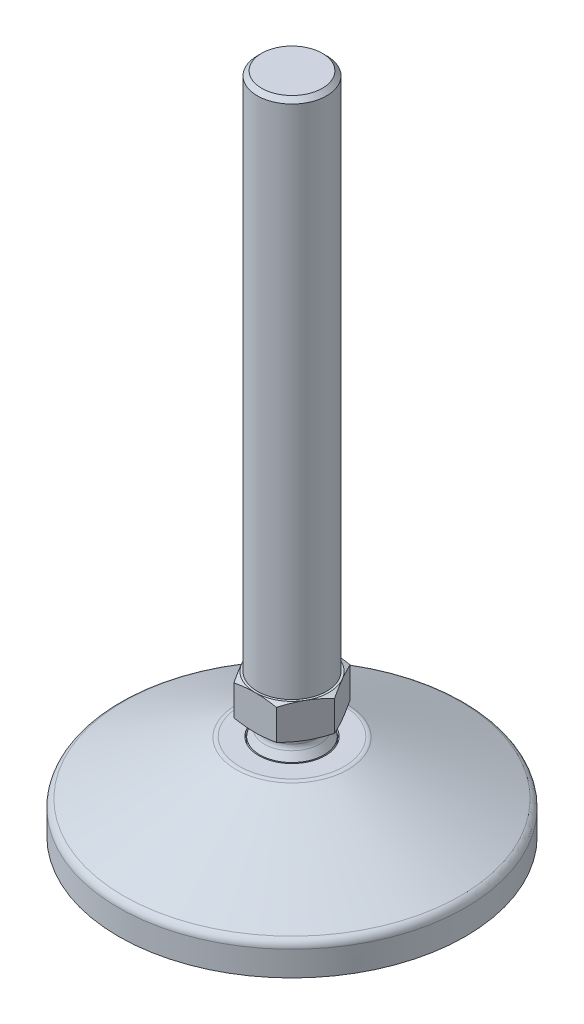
ISO-10303-21;
HEADER;
FILE_DESCRIPTION(('STEP AP214'),'2;1');
FILE_NAME('part.step','',(''),(''),'','','');
FILE_SCHEMA(('AUTOMOTIVE_DESIGN { 1 0 10303 214 1 1 1 1 }'));
ENDSEC;
DATA;
#1=APPLICATION_CONTEXT('core data for automotive mechanical design processes');
#2=APPLICATION_PROTOCOL_DEFINITION('international standard','automotive_design',2000,#1);
#3=PRODUCT_CONTEXT('',#1,'mechanical');
#4=PRODUCT('Part','Part','',(#3));
#5=PRODUCT_RELATED_PRODUCT_CATEGORY('part','',(#4));
#6=PRODUCT_DEFINITION_FORMATION('','',#4);
#7=PRODUCT_DEFINITION_CONTEXT('part definition',#1,'design');
#8=PRODUCT_DEFINITION('design','',#6,#7);
#9=PRODUCT_DEFINITION_SHAPE('','',#8);
#10=(LENGTH_UNIT() NAMED_UNIT(*) SI_UNIT(.MILLI.,.METRE.));
#11=(NAMED_UNIT(*) PLANE_ANGLE_UNIT() SI_UNIT($,.RADIAN.));
#12=(NAMED_UNIT(*) SI_UNIT($,.STERADIAN.) SOLID_ANGLE_UNIT());
#13=UNCERTAINTY_MEASURE_WITH_UNIT(LENGTH_MEASURE(1.E-05),#10,'distance_accuracy_value','');
#14=(GEOMETRIC_REPRESENTATION_CONTEXT(3) GLOBAL_UNCERTAINTY_ASSIGNED_CONTEXT((#13)) GLOBAL_UNIT_ASSIGNED_CONTEXT((#10,
#11,#12)) REPRESENTATION_CONTEXT('',''));
#15=CARTESIAN_POINT('',(0.,0.,0.));
#16=DIRECTION('',(0.,0.,1.));
#17=DIRECTION('',(1.,0.,0.));
#18=AXIS2_PLACEMENT_3D('',#15,#16,#17);
#19=CARTESIAN_POINT('',(0.,0.,0.));
#20=DIRECTION('',(0.,1.,0.));
#21=DIRECTION('',(0.,0.,1.));
#22=AXIS2_PLACEMENT_3D('',#19,#20,#21);
#23=PLANE('',#22);
#24=CARTESIAN_POINT('',(0.,0.,0.));
#25=DIRECTION('',(0.,-1.,0.));
#26=DIRECTION('',(0.,0.,-1.));
#27=AXIS2_PLACEMENT_3D('',#24,#25,#26);
#28=CIRCLE('',#27,31.5);
#29=CARTESIAN_POINT('',(-4.13114754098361,0.,31.227930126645));
#30=VERTEX_POINT('',#29);
#31=CARTESIAN_POINT('',(-30.6591619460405,0.,7.22950819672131));
#32=VERTEX_POINT('',#31);
#33=EDGE_CURVE('E608',#30,#32,#28,.T.);
#34=ORIENTED_EDGE('',*,*,#33,.F.);
#35=CARTESIAN_POINT('',(-4.,0.,30.2365672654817));
#36=DIRECTION('',(0.,1.,0.));
#37=DIRECTION('',(0.,0.,1.));
#38=AXIS2_PLACEMENT_3D('',#35,#36,#37);
#39=CIRCLE('',#38,1.);
#40=CARTESIAN_POINT('',(-3.,0.,30.2365672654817));
#41=VERTEX_POINT('',#40);
#42=EDGE_CURVE('E787',#30,#41,#39,.T.);
#43=ORIENTED_EDGE('',*,*,#42,.T.);
#44=DIRECTION('',(0.,0.,1.));
#45=VECTOR('',#44,1.);
#46=CARTESIAN_POINT('',(-3.,0.,6.));
#47=LINE('',#46,#45);
#48=CARTESIAN_POINT('',(-3.,0.,7.));
#49=VERTEX_POINT('',#48);
#50=EDGE_CURVE('E599',#49,#41,#47,.T.);
#51=ORIENTED_EDGE('',*,*,#50,.F.);
#52=CARTESIAN_POINT('',(-4.,0.,7.));
#53=DIRECTION('',(0.,1.,0.));
#54=DIRECTION('',(0.,0.,1.));
#55=AXIS2_PLACEMENT_3D('',#52,#53,#54);
#56=CIRCLE('',#55,1.);
#57=CARTESIAN_POINT('',(-4.,0.,6.));
#58=VERTEX_POINT('',#57);
#59=EDGE_CURVE('E790',#49,#58,#56,.T.);
#60=ORIENTED_EDGE('',*,*,#59,.T.);
#61=DIRECTION('',(1.,0.,0.));
#62=VECTOR('',#61,1.);
#63=CARTESIAN_POINT('',(-30.9232921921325,0.,6.));
#64=LINE('',#63,#62);
#65=CARTESIAN_POINT('',(-29.6858552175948,0.,6.));
#66=VERTEX_POINT('',#65);
#67=EDGE_CURVE('E604',#66,#58,#64,.T.);
#68=ORIENTED_EDGE('',*,*,#67,.F.);
#69=CARTESIAN_POINT('',(-29.6858552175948,0.,7.));
#70=DIRECTION('',(0.,1.,0.));
#71=DIRECTION('',(0.,0.,1.));
#72=AXIS2_PLACEMENT_3D('',#69,#70,#71);
#73=CIRCLE('',#72,1.);
#74=EDGE_CURVE('E793',#66,#32,#73,.T.);
#75=ORIENTED_EDGE('',*,*,#74,.T.);
#76=EDGE_LOOP('',(#34,#43,#51,#60,#68,#75));
#77=FACE_BOUND('',#76,.T.);
#78=CARTESIAN_POINT('',(0.,0.,0.));
#79=DIRECTION('',(0.,1.,0.));
#80=DIRECTION('',(0.,0.,1.));
#81=AXIS2_PLACEMENT_3D('',#78,#79,#80);
#82=CIRCLE('',#81,35.);
#83=CARTESIAN_POINT('',(0.,0.,35.));
#84=VERTEX_POINT('',#83);
#85=EDGE_CURVE('E352',#84,#84,#82,.T.);
#86=ORIENTED_EDGE('',*,*,#85,.F.);
#87=EDGE_LOOP('',(#86));
#88=FACE_BOUND('',#87,.T.);
#89=DIRECTION('',(0.,0.,-1.));
#90=VECTOR('',#89,1.);
#91=CARTESIAN_POINT('',(3.,0.,6.));
#92=LINE('',#91,#90);
#93=CARTESIAN_POINT('',(3.,0.,30.2365672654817));
#94=VERTEX_POINT('',#93);
#95=CARTESIAN_POINT('',(3.,0.,7.));
#96=VERTEX_POINT('',#95);
#97=EDGE_CURVE('E556',#94,#96,#92,.T.);
#98=ORIENTED_EDGE('',*,*,#97,.F.);
#99=CARTESIAN_POINT('',(4.,0.,30.2365672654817));
#100=DIRECTION('',(0.,1.,0.));
#101=DIRECTION('',(0.,0.,1.));
#102=AXIS2_PLACEMENT_3D('',#99,#100,#101);
#103=CIRCLE('',#102,1.);
#104=CARTESIAN_POINT('',(4.13114754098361,0.,31.227930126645));
#105=VERTEX_POINT('',#104);
#106=EDGE_CURVE('E781',#94,#105,#103,.T.);
#107=ORIENTED_EDGE('',*,*,#106,.T.);
#108=CARTESIAN_POINT('',(0.,0.,0.));
#109=DIRECTION('',(0.,-1.,0.));
#110=DIRECTION('',(0.,0.,-1.));
#111=AXIS2_PLACEMENT_3D('',#108,#109,#110);
#112=CIRCLE('',#111,31.5);
#113=CARTESIAN_POINT('',(30.6591619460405,0.,7.22950819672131));
#114=VERTEX_POINT('',#113);
#115=EDGE_CURVE('E564',#114,#105,#112,.T.);
#116=ORIENTED_EDGE('',*,*,#115,.F.);
#117=CARTESIAN_POINT('',(29.6858552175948,0.,7.));
#118=DIRECTION('',(0.,1.,0.));
#119=DIRECTION('',(0.,0.,1.));
#120=AXIS2_PLACEMENT_3D('',#117,#118,#119);
#121=CIRCLE('',#120,1.);
#122=CARTESIAN_POINT('',(29.6858552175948,0.,6.));
#123=VERTEX_POINT('',#122);
#124=EDGE_CURVE('E778',#114,#123,#121,.T.);
#125=ORIENTED_EDGE('',*,*,#124,.T.);
#126=DIRECTION('',(1.,0.,0.));
#127=VECTOR('',#126,1.);
#128=CARTESIAN_POINT('',(3.,0.,6.));
#129=LINE('',#128,#127);
#130=CARTESIAN_POINT('',(4.,0.,6.));
#131=VERTEX_POINT('',#130);
#132=EDGE_CURVE('E560',#131,#123,#129,.T.);
#133=ORIENTED_EDGE('',*,*,#132,.F.);
#134=CARTESIAN_POINT('',(4.,0.,7.));
#135=DIRECTION('',(0.,1.,0.));
#136=DIRECTION('',(0.,0.,1.));
#137=AXIS2_PLACEMENT_3D('',#134,#135,#136);
#138=CIRCLE('',#137,1.);
#139=EDGE_CURVE('E784',#131,#96,#138,.T.);
#140=ORIENTED_EDGE('',*,*,#139,.T.);
#141=EDGE_LOOP('',(#98,#107,#116,#125,#133,#140));
#142=FACE_BOUND('',#141,.T.);
#143=CARTESIAN_POINT('',(0.,0.,0.));
#144=DIRECTION('',(0.,-1.,0.));
#145=DIRECTION('',(0.,0.,-1.));
#146=AXIS2_PLACEMENT_3D('',#143,#144,#145);
#147=CIRCLE('',#146,31.5);
#148=CARTESIAN_POINT('',(-30.6591619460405,0.,-7.22950819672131));
#149=VERTEX_POINT('',#148);
#150=CARTESIAN_POINT('',(-4.13114754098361,0.,-31.227930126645));
#151=VERTEX_POINT('',#150);
#152=EDGE_CURVE('E584',#149,#151,#147,.T.);
#153=ORIENTED_EDGE('',*,*,#152,.F.);
#154=CARTESIAN_POINT('',(-29.6858552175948,0.,-7.));
#155=DIRECTION('',(0.,1.,0.));
#156=DIRECTION('',(0.,0.,1.));
#157=AXIS2_PLACEMENT_3D('',#154,#155,#156);
#158=CIRCLE('',#157,1.);
#159=CARTESIAN_POINT('',(-29.6858552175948,0.,-6.));
#160=VERTEX_POINT('',#159);
#161=EDGE_CURVE('E796',#149,#160,#158,.T.);
#162=ORIENTED_EDGE('',*,*,#161,.T.);
#163=DIRECTION('',(-1.,0.,0.));
#164=VECTOR('',#163,1.);
#165=CARTESIAN_POINT('',(-30.9232921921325,0.,-6.));
#166=LINE('',#165,#164);
#167=CARTESIAN_POINT('',(-4.,0.,-6.));
#168=VERTEX_POINT('',#167);
#169=EDGE_CURVE('E576',#168,#160,#166,.T.);
#170=ORIENTED_EDGE('',*,*,#169,.F.);
#171=CARTESIAN_POINT('',(-4.,0.,-7.));
#172=DIRECTION('',(0.,1.,0.));
#173=DIRECTION('',(0.,0.,1.));
#174=AXIS2_PLACEMENT_3D('',#171,#172,#173);
#175=CIRCLE('',#174,1.);
#176=CARTESIAN_POINT('',(-3.,0.,-7.));
#177=VERTEX_POINT('',#176);
#178=EDGE_CURVE('E12',#168,#177,#175,.T.);
#179=ORIENTED_EDGE('',*,*,#178,.T.);
#180=DIRECTION('',(0.,0.,1.));
#181=VECTOR('',#180,1.);
#182=CARTESIAN_POINT('',(-3.,0.,-31.3568174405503));
#183=LINE('',#182,#181);
#184=CARTESIAN_POINT('',(-3.,0.,-30.2365672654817));
#185=VERTEX_POINT('',#184);
#186=EDGE_CURVE('E581',#185,#177,#183,.T.);
#187=ORIENTED_EDGE('',*,*,#186,.F.);
#188=CARTESIAN_POINT('',(-4.,0.,-30.2365672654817));
#189=DIRECTION('',(0.,1.,0.));
#190=DIRECTION('',(0.,0.,1.));
#191=AXIS2_PLACEMENT_3D('',#188,#189,#190);
#192=CIRCLE('',#191,1.);
#193=EDGE_CURVE('E66',#185,#151,#192,.T.);
#194=ORIENTED_EDGE('',*,*,#193,.T.);
#195=EDGE_LOOP('',(#153,#162,#170,#179,#187,#194));
#196=FACE_BOUND('',#195,.T.);
#197=CARTESIAN_POINT('',(0.,0.,0.));
#198=DIRECTION('',(0.,-1.,0.));
#199=DIRECTION('',(0.,0.,-1.));
#200=AXIS2_PLACEMENT_3D('',#197,#198,#199);
#201=CIRCLE('',#200,31.5);
#202=CARTESIAN_POINT('',(4.13114754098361,0.,-31.227930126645));
#203=VERTEX_POINT('',#202);
#204=CARTESIAN_POINT('',(30.6591619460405,0.,-7.22950819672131));
#205=VERTEX_POINT('',#204);
#206=EDGE_CURVE('E632',#203,#205,#201,.T.);
#207=ORIENTED_EDGE('',*,*,#206,.F.);
#208=CARTESIAN_POINT('',(4.,0.,-30.2365672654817));
#209=DIRECTION('',(0.,1.,0.));
#210=DIRECTION('',(0.,0.,1.));
#211=AXIS2_PLACEMENT_3D('',#208,#209,#210);
#212=CIRCLE('',#211,1.);
#213=CARTESIAN_POINT('',(3.,0.,-30.2365672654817));
#214=VERTEX_POINT('',#213);
#215=EDGE_CURVE('E769',#203,#214,#212,.T.);
#216=ORIENTED_EDGE('',*,*,#215,.T.);
#217=DIRECTION('',(0.,0.,-1.));
#218=VECTOR('',#217,1.);
#219=CARTESIAN_POINT('',(3.,0.,-31.3568174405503));
#220=LINE('',#219,#218);
#221=CARTESIAN_POINT('',(3.,0.,-7.));
#222=VERTEX_POINT('',#221);
#223=EDGE_CURVE('E623',#222,#214,#220,.T.);
#224=ORIENTED_EDGE('',*,*,#223,.F.);
#225=CARTESIAN_POINT('',(4.,0.,-7.));
#226=DIRECTION('',(0.,1.,0.));
#227=DIRECTION('',(0.,0.,1.));
#228=AXIS2_PLACEMENT_3D('',#225,#226,#227);
#229=CIRCLE('',#228,1.);
#230=CARTESIAN_POINT('',(4.,0.,-6.));
#231=VERTEX_POINT('',#230);
#232=EDGE_CURVE('E772',#222,#231,#229,.T.);
#233=ORIENTED_EDGE('',*,*,#232,.T.);
#234=DIRECTION('',(-1.,0.,0.));
#235=VECTOR('',#234,1.);
#236=CARTESIAN_POINT('',(3.,0.,-6.));
#237=LINE('',#236,#235);
#238=CARTESIAN_POINT('',(29.6858552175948,0.,-6.));
#239=VERTEX_POINT('',#238);
#240=EDGE_CURVE('E628',#239,#231,#237,.T.);
#241=ORIENTED_EDGE('',*,*,#240,.F.);
#242=CARTESIAN_POINT('',(29.6858552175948,0.,-7.));
#243=DIRECTION('',(0.,1.,0.));
#244=DIRECTION('',(0.,0.,1.));
#245=AXIS2_PLACEMENT_3D('',#242,#243,#244);
#246=CIRCLE('',#245,1.);
#247=EDGE_CURVE('E775',#239,#205,#246,.T.);
#248=ORIENTED_EDGE('',*,*,#247,.T.);
#249=EDGE_LOOP('',(#207,#216,#224,#233,#241,#248));
#250=FACE_BOUND('',#249,.T.);
#251=ADVANCED_FACE('F57',(#77,#88,#142,#196,#250),#23,.F.);
#252=CARTESIAN_POINT('',(0.,27.,0.));
#253=DIRECTION('',(0.,1.,0.));
#254=DIRECTION('',(0.,0.,1.));
#255=AXIS2_PLACEMENT_3D('',#252,#253,#254);
#256=PLANE('',#255);
#257=CARTESIAN_POINT('',(0.,27.,0.));
#258=DIRECTION('',(0.,1.,0.));
#259=DIRECTION('',(0.,0.,1.));
#260=AXIS2_PLACEMENT_3D('',#257,#258,#259);
#261=CIRCLE('',#260,6.);
#262=CARTESIAN_POINT('',(0.,27.,6.));
#263=VERTEX_POINT('',#262);
#264=EDGE_CURVE('E320',#263,#263,#261,.T.);
#265=ORIENTED_EDGE('',*,*,#264,.T.);
#266=EDGE_LOOP('',(#265));
#267=FACE_BOUND('',#266,.T.);
#268=CARTESIAN_POINT('',(0.,27.,0.));
#269=DIRECTION('',(0.,1.,0.));
#270=DIRECTION('',(0.,0.,1.));
#271=AXIS2_PLACEMENT_3D('',#268,#269,#270);
#272=CIRCLE('',#271,8.5);
#273=CARTESIAN_POINT('',(0.,27.,8.5));
#274=VERTEX_POINT('',#273);
#275=CARTESIAN_POINT('',(7.36121593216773,27.,4.25));
#276=VERTEX_POINT('',#275);
#277=EDGE_CURVE('E526',#274,#276,#272,.T.);
#278=ORIENTED_EDGE('',*,*,#277,.F.);
#279=CARTESIAN_POINT('',(-7.36121593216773,27.,4.25));
#280=VERTEX_POINT('',#279);
#281=EDGE_CURVE('E531',#280,#274,#272,.T.);
#282=ORIENTED_EDGE('',*,*,#281,.F.);
#283=CARTESIAN_POINT('',(-7.36121593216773,27.,-4.25));
#284=VERTEX_POINT('',#283);
#285=EDGE_CURVE('E538',#284,#280,#272,.T.);
#286=ORIENTED_EDGE('',*,*,#285,.F.);
#287=CARTESIAN_POINT('',(0.,27.,-8.5));
#288=VERTEX_POINT('',#287);
#289=EDGE_CURVE('E543',#288,#284,#272,.T.);
#290=ORIENTED_EDGE('',*,*,#289,.F.);
#291=CARTESIAN_POINT('',(7.36121593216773,27.,-4.25));
#292=VERTEX_POINT('',#291);
#293=EDGE_CURVE('E535',#292,#288,#272,.T.);
#294=ORIENTED_EDGE('',*,*,#293,.F.);
#295=EDGE_CURVE('E296',#276,#292,#272,.T.);
#296=ORIENTED_EDGE('',*,*,#295,.F.);
#297=EDGE_LOOP('',(#278,#282,#286,#290,#294,#296));
#298=FACE_BOUND('',#297,.T.);
#299=ADVANCED_FACE('F834',(#267,#298),#256,.F.);
#300=CARTESIAN_POINT('',(0.,22.,0.));
#301=DIRECTION('',(0.,1.,0.));
#302=DIRECTION('',(0.,0.,1.));
#303=AXIS2_PLACEMENT_3D('',#300,#301,#302);
#304=PLANE('',#303);
#305=CARTESIAN_POINT('',(0.,22.,0.));
#306=DIRECTION('',(0.,1.,0.));
#307=DIRECTION('',(0.,0.,1.));
#308=AXIS2_PLACEMENT_3D('',#305,#306,#307);
#309=CIRCLE('',#308,12.05108886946);
#310=CARTESIAN_POINT('',(0.,22.,12.05108886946));
#311=VERTEX_POINT('',#310);
#312=EDGE_CURVE('E1546',#311,#311,#309,.T.);
#313=ORIENTED_EDGE('',*,*,#312,.T.);
#314=EDGE_LOOP('',(#313));
#315=FACE_BOUND('',#314,.T.);
#316=CARTESIAN_POINT('',(0.,22.,0.));
#317=DIRECTION('',(0.,1.,0.));
#318=DIRECTION('',(0.,0.,1.));
#319=AXIS2_PLACEMENT_3D('',#316,#317,#318);
#320=CIRCLE('',#319,7.7);
#321=CARTESIAN_POINT('',(0.,22.,7.7));
#322=VERTEX_POINT('',#321);
#323=EDGE_CURVE('E337',#322,#322,#320,.T.);
#324=ORIENTED_EDGE('',*,*,#323,.F.);
#325=EDGE_LOOP('',(#324));
#326=FACE_BOUND('',#325,.T.);
#327=ADVANCED_FACE('F840',(#315,#326),#304,.T.);
#328=CARTESIAN_POINT('',(0.,2.,0.));
#329=DIRECTION('',(0.,-1.,0.));
#330=DIRECTION('',(0.,0.,-1.));
#331=AXIS2_PLACEMENT_3D('',#328,#329,#330);
#332=CYLINDRICAL_SURFACE('',#331,35.);
#333=CARTESIAN_POINT('',(0.,2.,0.));
#334=DIRECTION('',(0.,1.,0.));
#335=DIRECTION('',(0.,0.,1.));
#336=AXIS2_PLACEMENT_3D('',#333,#334,#335);
#337=CIRCLE('',#336,35.);
#338=CARTESIAN_POINT('',(0.,2.,35.));
#339=VERTEX_POINT('',#338);
#340=EDGE_CURVE('E353',#339,#339,#337,.T.);
#341=ORIENTED_EDGE('',*,*,#340,.F.);
#342=EDGE_LOOP('',(#341));
#343=FACE_BOUND('',#342,.T.);
#344=ORIENTED_EDGE('',*,*,#85,.T.);
#345=EDGE_LOOP('',(#344));
#346=FACE_BOUND('',#345,.T.);
#347=ADVANCED_FACE('F849',(#343,#346),#332,.T.);
#348=CARTESIAN_POINT('',(0.,9.,0.));
#349=DIRECTION('',(0.,-1.,0.));
#350=DIRECTION('',(0.,0.,-1.));
#351=AXIS2_PLACEMENT_3D('',#348,#349,#350);
#352=CYLINDRICAL_SURFACE('',#351,40.);
#353=CARTESIAN_POINT('',(0.,7.73324201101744,0.));
#354=DIRECTION('',(0.,-1.,0.));
#355=DIRECTION('',(0.,0.,-1.));
#356=AXIS2_PLACEMENT_3D('',#353,#354,#355);
#357=CIRCLE('',#356,40.);
#358=CARTESIAN_POINT('',(0.,7.73324201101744,-40.));
#359=VERTEX_POINT('',#358);
#360=EDGE_CURVE('E1552',#359,#359,#357,.T.);
#361=ORIENTED_EDGE('',*,*,#360,.T.);
#362=EDGE_LOOP('',(#361));
#363=FACE_BOUND('',#362,.T.);
#364=CARTESIAN_POINT('',(0.,2.,0.));
#365=DIRECTION('',(0.,1.,0.));
#366=DIRECTION('',(0.,0.,1.));
#367=AXIS2_PLACEMENT_3D('',#364,#365,#366);
#368=CIRCLE('',#367,40.);
#369=CARTESIAN_POINT('',(0.,2.,40.));
#370=VERTEX_POINT('',#369);
#371=EDGE_CURVE('E345',#370,#370,#368,.T.);
#372=ORIENTED_EDGE('',*,*,#371,.T.);
#373=EDGE_LOOP('',(#372));
#374=FACE_BOUND('',#373,.T.);
#375=ADVANCED_FACE('F847',(#363,#374),#352,.T.);
#376=CARTESIAN_POINT('',(0.,2.,0.));
#377=DIRECTION('',(0.,1.,0.));
#378=DIRECTION('',(0.,0.,1.));
#379=AXIS2_PLACEMENT_3D('',#376,#377,#378);
#380=PLANE('',#379);
#381=ORIENTED_EDGE('',*,*,#340,.T.);
#382=EDGE_LOOP('',(#381));
#383=FACE_BOUND('',#382,.T.);
#384=ORIENTED_EDGE('',*,*,#371,.F.);
#385=EDGE_LOOP('',(#384));
#386=FACE_BOUND('',#385,.T.);
#387=ADVANCED_FACE('F1390',(#383,#386),#380,.F.);
#388=CARTESIAN_POINT('',(0.,22.,0.));
#389=DIRECTION('',(0.,-1.,0.));
#390=DIRECTION('',(0.,0.,-1.));
#391=AXIS2_PLACEMENT_3D('',#388,#389,#390);
#392=CONICAL_SURFACE('',#391,12.5,1.12920396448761);
#393=CARTESIAN_POINT('',(0.,9.54138654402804,0.));
#394=DIRECTION('',(0.,-1.,0.));
#395=DIRECTION('',(0.,0.,-1.));
#396=AXIS2_PLACEMENT_3D('',#393,#394,#395);
#397=CIRCLE('',#396,38.8547592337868);
#398=CARTESIAN_POINT('',(0.,9.54138654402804,-38.8547592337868));
#399=VERTEX_POINT('',#398);
#400=EDGE_CURVE('E1560',#399,#399,#397,.F.);
#401=CARTESIAN_POINT('',(0.,21.8081445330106,0.));
#402=DIRECTION('',(0.,1.,0.));
#403=DIRECTION('',(0.,0.,1.));
#404=AXIS2_PLACEMENT_3D('',#401,#402,#403);
#405=CIRCLE('',#404,12.9058481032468);
#406=CARTESIAN_POINT('',(0.,21.8081445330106,-12.9058481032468));
#407=VERTEX_POINT('',#406);
#408=EDGE_CURVE('E1605',#407,#407,#405,.F.);
#409=CARTESIAN_POINT('',(0.,9.54138654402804,-38.8547592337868));
#410=CARTESIAN_POINT('',(0.,9.66916527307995,-38.584458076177));
#411=CARTESIAN_POINT('',(0.,9.79694400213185,-38.3141569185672));
#412=CARTESIAN_POINT('',(0.,10.0525014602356,-37.7735546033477));
#413=CARTESIAN_POINT('',(0.,10.1802801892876,-37.5032534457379));
#414=CARTESIAN_POINT('',(0.,10.4358376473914,-36.9626511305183));
#415=CARTESIAN_POINT('',(0.,10.5636163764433,-36.6923499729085));
#416=CARTESIAN_POINT('',(0.,10.8191738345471,-36.1517476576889));
#417=CARTESIAN_POINT('',(0.,10.946952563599,-35.8814465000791));
#418=CARTESIAN_POINT('',(0.,11.2025100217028,-35.3408441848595));
#419=CARTESIAN_POINT('',(0.,11.3302887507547,-35.0705430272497));
#420=CARTESIAN_POINT('',(0.,11.5858462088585,-34.5299407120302));
#421=CARTESIAN_POINT('',(0.,11.7136249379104,-34.2596395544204));
#422=CARTESIAN_POINT('',(0.,11.9691823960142,-33.7190372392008));
#423=CARTESIAN_POINT('',(0.,12.0969611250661,-33.448736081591));
#424=CARTESIAN_POINT('',(0.,12.3525185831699,-32.9081337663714));
#425=CARTESIAN_POINT('',(0.,12.4802973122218,-32.6378326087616));
#426=CARTESIAN_POINT('',(0.,12.7358547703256,-32.097230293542));
#427=CARTESIAN_POINT('',(0.,12.8636334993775,-31.8269291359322));
#428=CARTESIAN_POINT('',(0.,13.1191909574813,-31.2863268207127));
#429=CARTESIAN_POINT('',(0.,13.2469696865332,-31.0160256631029));
#430=CARTESIAN_POINT('',(0.,13.502527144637,-30.4754233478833));
#431=CARTESIAN_POINT('',(0.,13.6303058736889,-30.2051221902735));
#432=CARTESIAN_POINT('',(0.,13.8858633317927,-29.6645198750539));
#433=CARTESIAN_POINT('',(0.,14.0136420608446,-29.3942187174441));
#434=CARTESIAN_POINT('',(0.,14.2691995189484,-28.8536164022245));
#435=CARTESIAN_POINT('',(0.,14.3969782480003,-28.5833152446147));
#436=CARTESIAN_POINT('',(0.,14.6525357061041,-28.0427129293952));
#437=CARTESIAN_POINT('',(0.,14.780314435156,-27.7724117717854));
#438=CARTESIAN_POINT('',(0.,15.0358718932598,-27.2318094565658));
#439=CARTESIAN_POINT('',(0.,15.1636506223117,-26.961508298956));
#440=CARTESIAN_POINT('',(0.,15.4192080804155,-26.4209059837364));
#441=CARTESIAN_POINT('',(0.,15.5469868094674,-26.1506048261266));
#442=CARTESIAN_POINT('',(0.,15.8025442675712,-25.610002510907));
#443=CARTESIAN_POINT('',(0.,15.9303229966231,-25.3397013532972));
#444=CARTESIAN_POINT('',(0.,16.1858804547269,-24.7990990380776));
#445=CARTESIAN_POINT('',(0.,16.3136591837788,-24.5287978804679));
#446=CARTESIAN_POINT('',(0.,16.5692166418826,-23.9881955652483));
#447=CARTESIAN_POINT('',(0.,16.6969953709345,-23.7178944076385));
#448=CARTESIAN_POINT('',(0.,16.9525528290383,-23.1772920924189));
#449=CARTESIAN_POINT('',(0.,17.0803315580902,-22.9069909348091));
#450=CARTESIAN_POINT('',(0.,17.335889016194,-22.3663886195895));
#451=CARTESIAN_POINT('',(0.,17.4636677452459,-22.0960874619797));
#452=CARTESIAN_POINT('',(0.,17.7192252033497,-21.5554851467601));
#453=CARTESIAN_POINT('',(0.,17.8470039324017,-21.2851839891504));
#454=CARTESIAN_POINT('',(0.,18.1025613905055,-20.7445816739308));
#455=CARTESIAN_POINT('',(0.,18.2303401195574,-20.474280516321));
#456=CARTESIAN_POINT('',(0.,18.4858975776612,-19.9336782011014));
#457=CARTESIAN_POINT('',(0.,18.6136763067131,-19.6633770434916));
#458=CARTESIAN_POINT('',(0.,18.8692337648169,-19.122774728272));
#459=CARTESIAN_POINT('',(0.,18.9970124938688,-18.8524735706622));
#460=CARTESIAN_POINT('',(0.,19.2525699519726,-18.3118712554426));
#461=CARTESIAN_POINT('',(0.,19.3803486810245,-18.0415700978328));
#462=CARTESIAN_POINT('',(0.,19.6359061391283,-17.5009677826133));
#463=CARTESIAN_POINT('',(0.,19.7636848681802,-17.2306666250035));
#464=CARTESIAN_POINT('',(0.,20.019242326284,-16.6900643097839));
#465=CARTESIAN_POINT('',(0.,20.1470210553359,-16.4197631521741));
#466=CARTESIAN_POINT('',(0.,20.4025785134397,-15.8791608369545));
#467=CARTESIAN_POINT('',(0.,20.5303572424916,-15.6088596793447));
#468=CARTESIAN_POINT('',(0.,20.7859147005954,-15.0682573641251));
#469=CARTESIAN_POINT('',(0.,20.9136934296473,-14.7979562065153));
#470=CARTESIAN_POINT('',(0.,21.1692508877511,-14.2573538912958));
#471=CARTESIAN_POINT('',(0.,21.297029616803,-13.987052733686));
#472=CARTESIAN_POINT('',(0.,21.5525870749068,-13.4464504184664));
#473=CARTESIAN_POINT('',(0.,21.6803658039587,-13.1761492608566));
#474=CARTESIAN_POINT('',(0.,21.8081445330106,-12.9058481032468));
#475=B_SPLINE_CURVE_WITH_KNOTS('',3,(#409,#410,#411,#412,#413,#414,#415,#416,#417,#418,#419,
#420,#421,#422,#423,#424,#425,#426,#427,#428,#429,#430,#431,#432,#433,#434,#435,#436,#437,#438,
#439,#440,#441,#442,#443,#444,#445,#446,#447,#448,#449,#450,#451,#452,#453,#454,#455,#456,#457,
#458,#459,#460,#461,#462,#463,#464,#465,#466,#467,#468,#469,#470,#471,#472,#473,#474),
.UNSPECIFIED.,.F.,.F.,(4,2,2,2,2,2,2,2,2,2,2,2,2,2,2,2,2,2,2,2,2,2,2,2,2,2,2,2,2,2,2,2,4),(0.,
0.896945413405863,1.79389082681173,2.69083624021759,3.58778165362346,4.48472706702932,
5.38167248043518,6.27861789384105,7.17556330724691,8.07250872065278,8.96945413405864,
9.8663995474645,10.7633449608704,11.6602903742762,12.5572357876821,13.454181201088,
14.3511266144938,15.2480720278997,16.1450174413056,17.0419628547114,17.9389082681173,
18.8358536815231,19.732799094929,20.6297445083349,21.5266899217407,22.4236353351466,
23.3205807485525,24.2175261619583,25.1144715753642,26.0114169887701,26.9083624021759,
27.8053078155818,28.7022532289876),.UNSPECIFIED.);
#476=EDGE_CURVE('BSEAM1382',#399,#407,#475,.T.);
#477=ORIENTED_EDGE('',*,*,#400,.T.);
#478=ORIENTED_EDGE('',*,*,#408,.T.);
#479=ORIENTED_EDGE('',*,*,#476,.T.);
#480=ORIENTED_EDGE('',*,*,#476,.F.);
#481=EDGE_LOOP('',(#477,#479,#478,#480));
#482=FACE_BOUND('',#481,.T.);
#483=ADVANCED_FACE('F1382',(#482),#392,.T.);
#484=CARTESIAN_POINT('',(0.,21.,0.));
#485=DIRECTION('',(0.,1.,0.));
#486=DIRECTION('',(0.,0.,1.));
#487=AXIS2_PLACEMENT_3D('',#484,#485,#486);
#488=CYLINDRICAL_SURFACE('',#487,7.7);
#489=CARTESIAN_POINT('',(0.,21.,0.));
#490=DIRECTION('',(0.,1.,0.));
#491=DIRECTION('',(0.,0.,1.));
#492=AXIS2_PLACEMENT_3D('',#489,#490,#491);
#493=CIRCLE('',#492,7.7);
#494=CARTESIAN_POINT('',(0.,21.,7.7));
#495=VERTEX_POINT('',#494);
#496=EDGE_CURVE('E341',#495,#495,#493,.T.);
#497=ORIENTED_EDGE('',*,*,#496,.F.);
#498=EDGE_LOOP('',(#497));
#499=FACE_BOUND('',#498,.T.);
#500=ORIENTED_EDGE('',*,*,#323,.T.);
#501=EDGE_LOOP('',(#500));
#502=FACE_BOUND('',#501,.T.);
#503=ADVANCED_FACE('F1372',(#499,#502),#488,.F.);
#504=CARTESIAN_POINT('',(0.,21.,0.));
#505=DIRECTION('',(0.,1.,0.));
#506=DIRECTION('',(0.,0.,1.));
#507=AXIS2_PLACEMENT_3D('',#504,#505,#506);
#508=PLANE('',#507);
#509=CARTESIAN_POINT('',(0.,21.,0.));
#510=DIRECTION('',(0.,1.,0.));
#511=DIRECTION('',(0.,0.,1.));
#512=AXIS2_PLACEMENT_3D('',#509,#510,#511);
#513=CIRCLE('',#512,7.4);
#514=CARTESIAN_POINT('',(0.,21.,7.4));
#515=VERTEX_POINT('',#514);
#516=EDGE_CURVE('E333',#515,#515,#513,.T.);
#517=ORIENTED_EDGE('',*,*,#516,.F.);
#518=EDGE_LOOP('',(#517));
#519=FACE_BOUND('',#518,.T.);
#520=ORIENTED_EDGE('',*,*,#496,.T.);
#521=EDGE_LOOP('',(#520));
#522=FACE_BOUND('',#521,.T.);
#523=ADVANCED_FACE('F1360',(#519,#522),#508,.T.);
#524=CARTESIAN_POINT('',(0.,21.,0.));
#525=DIRECTION('',(0.,1.,0.));
#526=DIRECTION('',(0.,0.,1.));
#527=AXIS2_PLACEMENT_3D('',#524,#525,#526);
#528=CYLINDRICAL_SURFACE('',#527,7.4);
#529=ORIENTED_EDGE('',*,*,#516,.T.);
#530=EDGE_LOOP('',(#529));
#531=FACE_BOUND('',#530,.T.);
#532=CARTESIAN_POINT('',(0.,22.,0.));
#533=DIRECTION('',(0.,1.,0.));
#534=DIRECTION('',(0.,0.,1.));
#535=AXIS2_PLACEMENT_3D('',#532,#533,#534);
#536=CIRCLE('',#535,7.4);
#537=CARTESIAN_POINT('',(0.,22.,7.4));
#538=VERTEX_POINT('',#537);
#539=EDGE_CURVE('E326',#538,#538,#536,.T.);
#540=ORIENTED_EDGE('',*,*,#539,.F.);
#541=EDGE_LOOP('',(#540));
#542=FACE_BOUND('',#541,.T.);
#543=ADVANCED_FACE('F1354',(#531,#542),#528,.T.);
#544=CARTESIAN_POINT('',(0.,24.1,0.));
#545=DIRECTION('',(0.,-1.,0.));
#546=DIRECTION('',(0.,0.,-1.));
#547=AXIS2_PLACEMENT_3D('',#544,#545,#546);
#548=CONICAL_SURFACE('',#547,6.,0.588002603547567);
#549=CARTESIAN_POINT('',(0.,23.5961508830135,0.));
#550=DIRECTION('',(0.,1.,0.));
#551=DIRECTION('',(0.,0.,1.));
#552=AXIS2_PLACEMENT_3D('',#549,#550,#551);
#553=CIRCLE('',#552,6.33589941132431);
#554=CARTESIAN_POINT('',(0.,23.5961508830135,6.33589941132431));
#555=VERTEX_POINT('',#554);
#556=EDGE_CURVE('E1557',#555,#555,#553,.F.);
#557=ORIENTED_EDGE('',*,*,#556,.T.);
#558=EDGE_LOOP('',(#557));
#559=FACE_BOUND('',#558,.T.);
#560=ORIENTED_EDGE('',*,*,#539,.T.);
#561=EDGE_LOOP('',(#560));
#562=FACE_BOUND('',#561,.T.);
#563=ADVANCED_FACE('F1359',(#559,#562),#548,.T.);
#564=CARTESIAN_POINT('',(0.,27.,0.));
#565=DIRECTION('',(0.,-1.,0.));
#566=DIRECTION('',(0.,0.,-1.));
#567=AXIS2_PLACEMENT_3D('',#564,#565,#566);
#568=CYLINDRICAL_SURFACE('',#567,6.);
#569=CARTESIAN_POINT('',(0.,24.705551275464,0.));
#570=DIRECTION('',(0.,1.,0.));
#571=DIRECTION('',(0.,0.,1.));
#572=AXIS2_PLACEMENT_3D('',#569,#570,#571);
#573=CIRCLE('',#572,6.);
#574=CARTESIAN_POINT('',(0.,24.705551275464,6.));
#575=VERTEX_POINT('',#574);
#576=EDGE_CURVE('E1551',#575,#575,#573,.T.);
#577=ORIENTED_EDGE('',*,*,#576,.T.);
#578=EDGE_LOOP('',(#577));
#579=FACE_BOUND('',#578,.T.);
#580=ORIENTED_EDGE('',*,*,#264,.F.);
#581=EDGE_LOOP('',(#580));
#582=FACE_BOUND('',#581,.T.);
#583=ADVANCED_FACE('F386',(#579,#582),#568,.T.);
#584=CARTESIAN_POINT('',(0.,27.,0.));
#585=DIRECTION('',(0.,1.,0.));
#586=DIRECTION('',(0.,0.,1.));
#587=AXIS2_PLACEMENT_3D('',#584,#585,#586);
#588=CONICAL_SURFACE('',#587,8.5,1.20743850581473);
#589=CARTESIAN_POINT('',(-14.7353592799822,30.2363082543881,8.5));
#590=CARTESIAN_POINT('',(-14.457346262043,30.1447427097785,8.5));
#591=CARTESIAN_POINT('',(-14.179143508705,30.0537533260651,8.5));
#592=CARTESIAN_POINT('',(-13.6223004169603,29.8731123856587,8.5));
#593=CARTESIAN_POINT('',(-13.3436600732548,29.7834608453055,8.5));
#594=CARTESIAN_POINT('',(-12.5068911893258,29.5167581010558,8.5));
#595=CARTESIAN_POINT('',(-11.9480288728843,29.3419965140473,8.5));
#596=CARTESIAN_POINT('',(-10.8206934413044,28.9984741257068,8.5));
#597=CARTESIAN_POINT('',(-10.2521883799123,28.8298176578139,8.5));
#598=CARTESIAN_POINT('',(-9.11190016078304,28.5039762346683,8.5));
#599=CARTESIAN_POINT('',(-8.54011714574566,28.3467907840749,8.5));
#600=CARTESIAN_POINT('',(-7.41468570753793,28.0541575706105,8.5));
#601=CARTESIAN_POINT('',(-6.86119721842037,27.9181020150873,8.5));
#602=CARTESIAN_POINT('',(-5.74951519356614,27.666257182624,8.5));
#603=CARTESIAN_POINT('',(-5.19132128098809,27.5504695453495,8.5));
#604=CARTESIAN_POINT('',(-4.07315643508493,27.3471053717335,8.5));
#605=CARTESIAN_POINT('',(-3.51321716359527,27.259360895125,8.5));
#606=CARTESIAN_POINT('',(-2.67007793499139,27.1542054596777,8.5));
#607=CARTESIAN_POINT('',(-2.38851252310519,27.1235650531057,8.5));
#608=CARTESIAN_POINT('',(-1.82448207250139,27.0719780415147,8.5));
#609=CARTESIAN_POINT('',(-1.54201703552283,27.0510314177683,8.5));
#610=CARTESIAN_POINT('',(-0.96345101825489,27.0187930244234,8.5));
#611=CARTESIAN_POINT('',(-0.667322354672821,27.0079914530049,8.5));
#612=CARTESIAN_POINT('',(-0.0748674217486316,26.9981660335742,8.5));
#613=CARTESIAN_POINT('',(0.221458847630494,26.9991421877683,8.5));
#614=CARTESIAN_POINT('',(0.813871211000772,27.0128344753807,8.5));
#615=CARTESIAN_POINT('',(1.10995727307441,27.0255519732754,8.5));
#616=CARTESIAN_POINT('',(1.70142527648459,27.0622452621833,8.5));
#617=CARTESIAN_POINT('',(1.99680721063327,27.0862211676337,8.5));
#618=CARTESIAN_POINT('',(2.58755566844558,27.1446925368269,8.5));
#619=CARTESIAN_POINT('',(2.88291856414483,27.1792243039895,8.5));
#620=CARTESIAN_POINT('',(3.47239887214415,27.2577133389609,8.5));
#621=CARTESIAN_POINT('',(3.76651617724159,27.3016714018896,8.5));
#622=CARTESIAN_POINT('',(4.64686245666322,27.4459363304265,8.5));
#623=CARTESIAN_POINT('',(5.23106637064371,27.5586318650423,8.5));
#624=CARTESIAN_POINT('',(6.39564570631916,27.8085792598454,8.5));
#625=CARTESIAN_POINT('',(6.97600696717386,27.9458951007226,8.5));
#626=CARTESIAN_POINT('',(8.13222437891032,28.2379526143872,8.5));
#627=CARTESIAN_POINT('',(8.70808093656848,28.392692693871,8.5));
#628=CARTESIAN_POINT('',(9.85567443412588,28.7145138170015,8.5));
#629=CARTESIAN_POINT('',(10.4274149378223,28.881582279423,8.5));
#630=CARTESIAN_POINT('',(11.5681492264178,29.2247830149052,8.5));
#631=CARTESIAN_POINT('',(12.1371430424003,29.4009151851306,8.5));
#632=CARTESIAN_POINT('',(12.874903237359,29.6340790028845,8.5));
#633=CARTESIAN_POINT('',(13.0446430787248,29.6880544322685,8.5));
#634=CARTESIAN_POINT('',(13.3839475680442,29.7965615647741,8.5));
#635=CARTESIAN_POINT('',(13.5535122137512,29.851093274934,8.5));
#636=CARTESIAN_POINT('',(13.8918786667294,29.9604720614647,8.5));
#637=CARTESIAN_POINT('',(14.060681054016,30.0153173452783,8.5));
#638=CARTESIAN_POINT('',(14.3981321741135,30.1254733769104,8.5));
#639=CARTESIAN_POINT('',(14.5667809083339,30.1807841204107,8.5));
#640=CARTESIAN_POINT('',(14.7353592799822,30.2363082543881,8.5));
#641=B_SPLINE_CURVE_WITH_KNOTS('',3,(#589,#590,#591,#592,#593,#594,#595,#596,#597,#598,#599,
#600,#601,#602,#603,#604,#605,#606,#607,#608,#609,#610,#611,#612,#613,#614,#615,#616,#617,#618,
#619,#620,#621,#622,#623,#624,#625,#626,#627,#628,#629,#630,#631,#632,#633,#634,#635,#636,#637,
#638,#639,#640),.UNSPECIFIED.,.F.,.F.,(4,2,2,2,2,2,2,2,2,2,2,2,2,2,2,2,2,2,2,2,2,2,2,2,2,4),(0.,
0.878110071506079,1.75623085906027,3.51283288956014,5.29173302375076,7.07055629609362,
8.78017376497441,10.4899294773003,12.189245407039,13.0387870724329,13.8883270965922,
14.7770744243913,15.6658219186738,16.5546727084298,17.4435325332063,18.3354843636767,
19.2275114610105,21.0116241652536,22.8004422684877,24.5890969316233,26.3759508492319,
28.1627844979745,28.697129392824,29.2314810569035,29.7639466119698,30.2964072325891),.UNSPECIFIED.);
#642=CARTESIAN_POINT('',(4.90747728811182,27.5,8.5));
#643=VERTEX_POINT('',#642);
#644=EDGE_CURVE('E357',#274,#643,#641,.T.);
#645=ORIENTED_EDGE('',*,*,#644,.F.);
#646=ORIENTED_EDGE('',*,*,#277,.T.);
#647=CARTESIAN_POINT('',(4.90736181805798,27.5000439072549,8.5002));
#648=CARTESIAN_POINT('',(5.08958947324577,27.4307418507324,8.1845724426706));
#649=CARTESIAN_POINT('',(5.27239119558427,27.367021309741,7.86795057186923));
#650=CARTESIAN_POINT('',(5.63913790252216,27.2529252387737,7.23272664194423));
#651=CARTESIAN_POINT('',(5.8230835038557,27.2025576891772,6.91412351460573));
#652=CARTESIAN_POINT('',(6.19173967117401,27.1174734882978,6.2755923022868));
#653=CARTESIAN_POINT('',(6.37644945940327,27.0827436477,5.95566556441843));
#654=CARTESIAN_POINT('',(6.74644847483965,27.030713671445,5.31480847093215));
#655=CARTESIAN_POINT('',(6.93173755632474,27.0134094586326,4.99387836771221));
#656=CARTESIAN_POINT('',(7.29964752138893,26.9973678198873,4.35663961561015));
#657=CARTESIAN_POINT('',(7.4822652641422,26.9983468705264,4.04033640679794));
#658=CARTESIAN_POINT('',(7.84727420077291,27.0181202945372,3.40812238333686));
#659=CARTESIAN_POINT('',(8.02966536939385,27.0369165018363,3.09221161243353));
#660=CARTESIAN_POINT('',(8.39370530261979,27.0912379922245,2.46167595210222));
#661=CARTESIAN_POINT('',(8.5753544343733,27.1267536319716,2.14705042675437));
#662=CARTESIAN_POINT('',(8.93776228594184,27.2127193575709,1.51934161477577));
#663=CARTESIAN_POINT('',(9.11852099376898,27.2631696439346,1.20625834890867));
#664=CARTESIAN_POINT('',(9.34186038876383,27.3336241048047,0.819423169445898));
#665=CARTESIAN_POINT('',(9.384934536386,27.34758810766,0.744816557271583));
#666=CARTESIAN_POINT('',(9.47101931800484,27.3762182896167,0.595713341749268));
#667=CARTESIAN_POINT('',(9.51402995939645,27.3908843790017,0.521216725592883));
#668=CARTESIAN_POINT('',(9.60007768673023,27.4209211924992,0.372177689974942));
#669=CARTESIAN_POINT('',(9.64311465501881,27.4362932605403,0.297635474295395));
#670=CARTESIAN_POINT('',(9.72913428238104,27.4676880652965,0.148645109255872));
#671=CARTESIAN_POINT('',(9.77211693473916,27.4837108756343,0.074196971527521));
#672=CARTESIAN_POINT('',(9.81507004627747,27.5000439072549,-0.000200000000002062));
#673=B_SPLINE_CURVE_WITH_KNOTS('',3,(#647,#648,#649,#650,#651,#652,#653,#654,#655,#656,#657,
#658,#659,#660,#661,#662,#663,#664,#665,#666,#667,#668,#669,#670,#671,#672),.UNSPECIFIED.,.F.,
.F.,(4,2,2,2,2,2,2,2,2,2,2,2,4),(0.,1.11304214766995,2.22674800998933,3.33951277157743,
4.45201711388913,5.54728408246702,6.64266379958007,7.73741250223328,8.83217590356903,
9.09399348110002,9.35577769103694,9.61808276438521,9.88041759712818),.UNSPECIFIED.);
#674=EDGE_CURVE('E310',#643,#276,#673,.T.);
#675=ORIENTED_EDGE('',*,*,#674,.F.);
#676=EDGE_LOOP('',(#645,#646,#675));
#677=FACE_BOUND('',#676,.T.);
#678=ADVANCED_FACE('F382',(#677),#588,.T.);
#679=ORIENTED_EDGE('',*,*,#281,.T.);
#680=CARTESIAN_POINT('',(-4.90747728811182,27.5,8.5));
#681=VERTEX_POINT('',#680);
#682=EDGE_CURVE('E370',#681,#274,#641,.T.);
#683=ORIENTED_EDGE('',*,*,#682,.F.);
#684=CARTESIAN_POINT('',(-9.81507004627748,27.5000439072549,-0.000200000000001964));
#685=CARTESIAN_POINT('',(-9.63284239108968,27.4307418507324,0.315427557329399));
#686=CARTESIAN_POINT('',(-9.45004066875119,27.367021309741,0.632049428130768));
#687=CARTESIAN_POINT('',(-9.0832939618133,27.2529252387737,1.26727335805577));
#688=CARTESIAN_POINT('',(-8.89934836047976,27.2025576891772,1.58587648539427));
#689=CARTESIAN_POINT('',(-8.53069219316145,27.1174734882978,2.2244076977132));
#690=CARTESIAN_POINT('',(-8.34598240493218,27.0827436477,2.54433443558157));
#691=CARTESIAN_POINT('',(-7.9759833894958,27.030713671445,3.18519152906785));
#692=CARTESIAN_POINT('',(-7.79069430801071,27.0134094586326,3.50612163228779));
#693=CARTESIAN_POINT('',(-7.42278434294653,26.9973678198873,4.14336038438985));
#694=CARTESIAN_POINT('',(-7.24016660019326,26.9983468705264,4.45966359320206));
#695=CARTESIAN_POINT('',(-6.87515766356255,27.0181202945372,5.09187761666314));
#696=CARTESIAN_POINT('',(-6.69276649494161,27.0369165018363,5.40778838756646));
#697=CARTESIAN_POINT('',(-6.32872656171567,27.0912379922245,6.03832404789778));
#698=CARTESIAN_POINT('',(-6.14707742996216,27.1267536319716,6.35294957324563));
#699=CARTESIAN_POINT('',(-5.78466957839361,27.2127193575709,6.98065838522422));
#700=CARTESIAN_POINT('',(-5.60391087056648,27.2631696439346,7.29374165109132));
#701=CARTESIAN_POINT('',(-5.38057147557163,27.3336241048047,7.6805768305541));
#702=CARTESIAN_POINT('',(-5.33749732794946,27.34758810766,7.75518344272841));
#703=CARTESIAN_POINT('',(-5.25141254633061,27.3762182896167,7.90428665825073));
#704=CARTESIAN_POINT('',(-5.20840190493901,27.3908843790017,7.97878327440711));
#705=CARTESIAN_POINT('',(-5.12235417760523,27.4209211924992,8.12782231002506));
#706=CARTESIAN_POINT('',(-5.07931720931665,27.4362932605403,8.2023645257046));
#707=CARTESIAN_POINT('',(-4.99329758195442,27.4676880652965,8.35135489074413));
#708=CARTESIAN_POINT('',(-4.95031492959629,27.4837108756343,8.42580302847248));
#709=CARTESIAN_POINT('',(-4.90736181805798,27.5000439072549,8.5002));
#710=B_SPLINE_CURVE_WITH_KNOTS('',3,(#684,#685,#686,#687,#688,#689,#690,#691,#692,#693,#694,
#695,#696,#697,#698,#699,#700,#701,#702,#703,#704,#705,#706,#707,#708,#709),.UNSPECIFIED.,.F.,
.F.,(4,2,2,2,2,2,2,2,2,2,2,2,4),(0.,1.11304214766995,2.22674800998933,3.33951277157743,
4.45201711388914,5.54728408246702,6.64266379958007,7.73741250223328,8.83217590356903,
9.09399348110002,9.35577769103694,9.61808276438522,9.88041759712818),.UNSPECIFIED.);
#711=EDGE_CURVE('E397',#280,#681,#710,.T.);
#712=ORIENTED_EDGE('',*,*,#711,.F.);
#713=EDGE_LOOP('',(#679,#683,#712));
#714=FACE_BOUND('',#713,.T.);
#715=ADVANCED_FACE('F385',(#714),#588,.T.);
#716=ORIENTED_EDGE('',*,*,#285,.T.);
#717=CARTESIAN_POINT('',(-9.81495457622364,27.5,0.));
#718=VERTEX_POINT('',#717);
#719=EDGE_CURVE('E502',#718,#280,#710,.T.);
#720=ORIENTED_EDGE('',*,*,#719,.F.);
#721=CARTESIAN_POINT('',(-4.90736181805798,27.5000439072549,-8.5002));
#722=CARTESIAN_POINT('',(-5.08958947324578,27.4307418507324,-8.1845724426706));
#723=CARTESIAN_POINT('',(-5.27239119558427,27.367021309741,-7.86795057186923));
#724=CARTESIAN_POINT('',(-5.63913790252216,27.2529252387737,-7.23272664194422));
#725=CARTESIAN_POINT('',(-5.8230835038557,27.2025576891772,-6.91412351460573));
#726=CARTESIAN_POINT('',(-6.19173967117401,27.1174734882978,-6.2755923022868));
#727=CARTESIAN_POINT('',(-6.37644945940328,27.0827436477,-5.95566556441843));
#728=CARTESIAN_POINT('',(-6.74644847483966,27.030713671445,-5.31480847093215));
#729=CARTESIAN_POINT('',(-6.93173755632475,27.0134094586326,-4.99387836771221));
#730=CARTESIAN_POINT('',(-7.29964752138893,26.9973678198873,-4.35663961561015));
#731=CARTESIAN_POINT('',(-7.4822652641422,26.9983468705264,-4.04033640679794));
#732=CARTESIAN_POINT('',(-7.84727420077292,27.0181202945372,-3.40812238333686));
#733=CARTESIAN_POINT('',(-8.02966536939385,27.0369165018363,-3.09221161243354));
#734=CARTESIAN_POINT('',(-8.39370530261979,27.0912379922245,-2.46167595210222));
#735=CARTESIAN_POINT('',(-8.5753544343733,27.1267536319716,-2.14705042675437));
#736=CARTESIAN_POINT('',(-8.93776228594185,27.2127193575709,-1.51934161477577));
#737=CARTESIAN_POINT('',(-9.11852099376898,27.2631696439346,-1.20625834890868));
#738=CARTESIAN_POINT('',(-9.34186038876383,27.3336241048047,-0.819423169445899));
#739=CARTESIAN_POINT('',(-9.384934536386,27.34758810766,-0.744816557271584));
#740=CARTESIAN_POINT('',(-9.47101931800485,27.3762182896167,-0.59571334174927));
#741=CARTESIAN_POINT('',(-9.51402995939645,27.3908843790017,-0.521216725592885));
#742=CARTESIAN_POINT('',(-9.60007768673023,27.4209211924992,-0.372177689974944));
#743=CARTESIAN_POINT('',(-9.64311465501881,27.4362932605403,-0.297635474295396));
#744=CARTESIAN_POINT('',(-9.72913428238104,27.4676880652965,-0.148645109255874));
#745=CARTESIAN_POINT('',(-9.77211693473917,27.4837108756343,-0.0741969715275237));
#746=CARTESIAN_POINT('',(-9.81507004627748,27.5000439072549,0.000199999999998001));
#747=B_SPLINE_CURVE_WITH_KNOTS('',3,(#721,#722,#723,#724,#725,#726,#727,#728,#729,#730,#731,
#732,#733,#734,#735,#736,#737,#738,#739,#740,#741,#742,#743,#744,#745,#746),.UNSPECIFIED.,.F.,
.F.,(4,2,2,2,2,2,2,2,2,2,2,2,4),(0.,1.11304214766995,2.22674800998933,3.33951277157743,
4.45201711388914,5.54728408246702,6.64266379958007,7.73741250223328,8.83217590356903,
9.09399348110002,9.35577769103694,9.61808276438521,9.88041759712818),.UNSPECIFIED.);
#748=EDGE_CURVE('E405',#284,#718,#747,.T.);
#749=ORIENTED_EDGE('',*,*,#748,.F.);
#750=EDGE_LOOP('',(#716,#720,#749));
#751=FACE_BOUND('',#750,.T.);
#752=ADVANCED_FACE('F1318',(#751),#588,.T.);
#753=ORIENTED_EDGE('',*,*,#289,.T.);
#754=CARTESIAN_POINT('',(-4.90747728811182,27.5,-8.5));
#755=VERTEX_POINT('',#754);
#756=EDGE_CURVE('E486',#755,#284,#747,.T.);
#757=ORIENTED_EDGE('',*,*,#756,.F.);
#758=CARTESIAN_POINT('',(14.7353592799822,30.2363082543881,-8.5));
#759=CARTESIAN_POINT('',(14.457346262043,30.1447427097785,-8.5));
#760=CARTESIAN_POINT('',(14.179143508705,30.0537533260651,-8.5));
#761=CARTESIAN_POINT('',(13.6223004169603,29.8731123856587,-8.5));
#762=CARTESIAN_POINT('',(13.3436600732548,29.7834608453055,-8.5));
#763=CARTESIAN_POINT('',(12.5068911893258,29.5167581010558,-8.5));
#764=CARTESIAN_POINT('',(11.9480288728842,29.3419965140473,-8.5));
#765=CARTESIAN_POINT('',(10.8206934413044,28.9984741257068,-8.5));
#766=CARTESIAN_POINT('',(10.2521883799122,28.8298176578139,-8.5));
#767=CARTESIAN_POINT('',(9.11190016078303,28.5039762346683,-8.5));
#768=CARTESIAN_POINT('',(8.54011714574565,28.3467907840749,-8.5));
#769=CARTESIAN_POINT('',(7.41468570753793,28.0541575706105,-8.5));
#770=CARTESIAN_POINT('',(6.86119721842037,27.9181020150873,-8.5));
#771=CARTESIAN_POINT('',(5.74951519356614,27.666257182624,-8.5));
#772=CARTESIAN_POINT('',(5.19132128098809,27.5504695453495,-8.5));
#773=CARTESIAN_POINT('',(4.07315643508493,27.3471053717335,-8.5));
#774=CARTESIAN_POINT('',(3.51321716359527,27.259360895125,-8.5));
#775=CARTESIAN_POINT('',(2.67007793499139,27.1542054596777,-8.5));
#776=CARTESIAN_POINT('',(2.38851252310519,27.1235650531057,-8.5));
#777=CARTESIAN_POINT('',(1.82448207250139,27.0719780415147,-8.5));
#778=CARTESIAN_POINT('',(1.54201703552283,27.0510314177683,-8.5));
#779=CARTESIAN_POINT('',(0.963451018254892,27.0187930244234,-8.5));
#780=CARTESIAN_POINT('',(0.667322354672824,27.0079914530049,-8.5));
#781=CARTESIAN_POINT('',(0.0748674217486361,26.9981660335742,-8.5));
#782=CARTESIAN_POINT('',(-0.221458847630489,26.9991421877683,-8.5));
#783=CARTESIAN_POINT('',(-0.813871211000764,27.0128344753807,-8.5));
#784=CARTESIAN_POINT('',(-1.1099572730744,27.0255519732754,-8.5));
#785=CARTESIAN_POINT('',(-1.70142527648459,27.0622452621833,-8.5));
#786=CARTESIAN_POINT('',(-1.99680721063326,27.0862211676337,-8.5));
#787=CARTESIAN_POINT('',(-2.58755566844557,27.1446925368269,-8.5));
#788=CARTESIAN_POINT('',(-2.88291856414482,27.1792243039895,-8.5));
#789=CARTESIAN_POINT('',(-3.47239887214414,27.2577133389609,-8.5));
#790=CARTESIAN_POINT('',(-3.76651617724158,27.3016714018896,-8.5));
#791=CARTESIAN_POINT('',(-4.64686245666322,27.4459363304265,-8.5));
#792=CARTESIAN_POINT('',(-5.2310663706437,27.5586318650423,-8.5));
#793=CARTESIAN_POINT('',(-6.39564570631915,27.8085792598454,-8.5));
#794=CARTESIAN_POINT('',(-6.97600696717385,27.9458951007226,-8.5));
#795=CARTESIAN_POINT('',(-8.13222437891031,28.2379526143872,-8.5));
#796=CARTESIAN_POINT('',(-8.70808093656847,28.392692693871,-8.5));
#797=CARTESIAN_POINT('',(-9.85567443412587,28.7145138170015,-8.5));
#798=CARTESIAN_POINT('',(-10.4274149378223,28.881582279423,-8.5));
#799=CARTESIAN_POINT('',(-11.5681492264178,29.2247830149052,-8.5));
#800=CARTESIAN_POINT('',(-12.1371430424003,29.4009151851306,-8.5));
#801=CARTESIAN_POINT('',(-12.8749032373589,29.6340790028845,-8.5));
#802=CARTESIAN_POINT('',(-13.0446430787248,29.6880544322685,-8.5));
#803=CARTESIAN_POINT('',(-13.3839475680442,29.7965615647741,-8.5));
#804=CARTESIAN_POINT('',(-13.5535122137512,29.851093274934,-8.5));
#805=CARTESIAN_POINT('',(-13.8918786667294,29.9604720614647,-8.5));
#806=CARTESIAN_POINT('',(-14.060681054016,30.0153173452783,-8.5));
#807=CARTESIAN_POINT('',(-14.3981321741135,30.1254733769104,-8.5));
#808=CARTESIAN_POINT('',(-14.5667809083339,30.1807841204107,-8.5));
#809=CARTESIAN_POINT('',(-14.7353592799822,30.2363082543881,-8.5));
#810=B_SPLINE_CURVE_WITH_KNOTS('',3,(#758,#759,#760,#761,#762,#763,#764,#765,#766,#767,#768,
#769,#770,#771,#772,#773,#774,#775,#776,#777,#778,#779,#780,#781,#782,#783,#784,#785,#786,#787,
#788,#789,#790,#791,#792,#793,#794,#795,#796,#797,#798,#799,#800,#801,#802,#803,#804,#805,#806,
#807,#808,#809),.UNSPECIFIED.,.F.,.F.,(4,2,2,2,2,2,2,2,2,2,2,2,2,2,2,2,2,2,2,2,2,2,2,2,2,4),(0.,
0.878110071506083,1.75623085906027,3.51283288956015,5.29173302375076,7.07055629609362,
8.7801737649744,10.4899294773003,12.189245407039,13.0387870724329,13.8883270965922,
14.7770744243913,15.6658219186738,16.5546727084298,17.4435325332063,18.3354843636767,
19.2275114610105,21.0116241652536,22.8004422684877,24.5890969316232,26.3759508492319,
28.1627844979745,28.697129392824,29.2314810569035,29.7639466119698,30.2964072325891),.UNSPECIFIED.);
#811=EDGE_CURVE('E412',#288,#755,#810,.T.);
#812=ORIENTED_EDGE('',*,*,#811,.F.);
#813=EDGE_LOOP('',(#753,#757,#812));
#814=FACE_BOUND('',#813,.T.);
#815=ADVANCED_FACE('F1309',(#814),#588,.T.);
#816=ORIENTED_EDGE('',*,*,#293,.T.);
#817=CARTESIAN_POINT('',(4.90747728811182,27.5,-8.5));
#818=VERTEX_POINT('',#817);
#819=EDGE_CURVE('E424',#818,#288,#810,.T.);
#820=ORIENTED_EDGE('',*,*,#819,.F.);
#821=CARTESIAN_POINT('',(9.81507004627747,27.5000439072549,0.000199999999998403));
#822=CARTESIAN_POINT('',(9.63284239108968,27.4307418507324,-0.315427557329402));
#823=CARTESIAN_POINT('',(9.45004066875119,27.367021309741,-0.632049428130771));
#824=CARTESIAN_POINT('',(9.08329396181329,27.2529252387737,-1.26727335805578));
#825=CARTESIAN_POINT('',(8.89934836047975,27.2025576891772,-1.58587648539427));
#826=CARTESIAN_POINT('',(8.53069219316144,27.1174734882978,-2.2244076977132));
#827=CARTESIAN_POINT('',(8.34598240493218,27.0827436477,-2.54433443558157));
#828=CARTESIAN_POINT('',(7.9759833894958,27.030713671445,-3.18519152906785));
#829=CARTESIAN_POINT('',(7.79069430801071,27.0134094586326,-3.50612163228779));
#830=CARTESIAN_POINT('',(7.42278434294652,26.9973678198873,-4.14336038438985));
#831=CARTESIAN_POINT('',(7.24016660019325,26.9983468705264,-4.45966359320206));
#832=CARTESIAN_POINT('',(6.87515766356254,27.0181202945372,-5.09187761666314));
#833=CARTESIAN_POINT('',(6.6927664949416,27.0369165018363,-5.40778838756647));
#834=CARTESIAN_POINT('',(6.32872656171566,27.0912379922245,-6.03832404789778));
#835=CARTESIAN_POINT('',(6.14707742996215,27.1267536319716,-6.35294957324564));
#836=CARTESIAN_POINT('',(5.78466957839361,27.2127193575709,-6.98065838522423));
#837=CARTESIAN_POINT('',(5.60391087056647,27.2631696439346,-7.29374165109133));
#838=CARTESIAN_POINT('',(5.38057147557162,27.3336241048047,-7.6805768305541));
#839=CARTESIAN_POINT('',(5.33749732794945,27.34758810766,-7.75518344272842));
#840=CARTESIAN_POINT('',(5.25141254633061,27.3762182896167,-7.90428665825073));
#841=CARTESIAN_POINT('',(5.208401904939,27.3908843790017,-7.97878327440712));
#842=CARTESIAN_POINT('',(5.12235417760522,27.4209211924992,-8.12782231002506));
#843=CARTESIAN_POINT('',(5.07931720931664,27.4362932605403,-8.2023645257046));
#844=CARTESIAN_POINT('',(4.99329758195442,27.4676880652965,-8.35135489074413));
#845=CARTESIAN_POINT('',(4.95031492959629,27.4837108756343,-8.42580302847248));
#846=CARTESIAN_POINT('',(4.90736181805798,27.5000439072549,-8.5002));
#847=B_SPLINE_CURVE_WITH_KNOTS('',3,(#821,#822,#823,#824,#825,#826,#827,#828,#829,#830,#831,
#832,#833,#834,#835,#836,#837,#838,#839,#840,#841,#842,#843,#844,#845,#846),.UNSPECIFIED.,.F.,
.F.,(4,2,2,2,2,2,2,2,2,2,2,2,4),(0.,1.11304214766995,2.22674800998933,3.33951277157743,
4.45201711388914,5.54728408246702,6.64266379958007,7.73741250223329,8.83217590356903,
9.09399348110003,9.35577769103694,9.61808276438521,9.88041759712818),.UNSPECIFIED.);
#848=EDGE_CURVE('E303',#292,#818,#847,.T.);
#849=ORIENTED_EDGE('',*,*,#848,.F.);
#850=EDGE_LOOP('',(#816,#820,#849));
#851=FACE_BOUND('',#850,.T.);
#852=ADVANCED_FACE('F1300',(#851),#588,.T.);
#853=ORIENTED_EDGE('',*,*,#295,.T.);
#854=CARTESIAN_POINT('',(9.81495457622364,27.5,0.));
#855=VERTEX_POINT('',#854);
#856=EDGE_CURVE('E290',#855,#292,#847,.T.);
#857=ORIENTED_EDGE('',*,*,#856,.F.);
#858=EDGE_CURVE('E293',#276,#855,#673,.T.);
#859=ORIENTED_EDGE('',*,*,#858,.F.);
#860=EDGE_LOOP('',(#853,#857,#859));
#861=FACE_BOUND('',#860,.T.);
#862=ADVANCED_FACE('F292',(#861),#588,.T.);
#863=CARTESIAN_POINT('',(-4.90747728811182,35.,8.5));
#864=DIRECTION('',(0.,0.,-1.));
#865=DIRECTION('',(-1.,0.,0.));
#866=AXIS2_PLACEMENT_3D('',#863,#864,#865);
#867=PLANE('',#866);
#868=DIRECTION('',(0.,-1.,0.));
#869=VECTOR('',#868,1.);
#870=CARTESIAN_POINT('',(4.90747728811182,35.,8.5));
#871=LINE('',#870,#869);
#872=CARTESIAN_POINT('',(4.90747728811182,34.5,8.5));
#873=VERTEX_POINT('',#872);
#874=EDGE_CURVE('E467',#873,#643,#871,.T.);
#875=ORIENTED_EDGE('',*,*,#874,.F.);
#876=CARTESIAN_POINT('',(14.7353592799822,31.7636917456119,8.5));
#877=CARTESIAN_POINT('',(14.457346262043,31.8552572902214,8.5));
#878=CARTESIAN_POINT('',(14.179143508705,31.9462466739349,8.5));
#879=CARTESIAN_POINT('',(13.6223004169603,32.1268876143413,8.5));
#880=CARTESIAN_POINT('',(13.3436600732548,32.2165391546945,8.5));
#881=CARTESIAN_POINT('',(12.5068911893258,32.4832418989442,8.5));
#882=CARTESIAN_POINT('',(11.9480288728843,32.6580034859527,8.5));
#883=CARTESIAN_POINT('',(10.8206934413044,33.0015258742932,8.5));
#884=CARTESIAN_POINT('',(10.2521883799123,33.1701823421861,8.5));
#885=CARTESIAN_POINT('',(9.11190016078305,33.4960237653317,8.5));
#886=CARTESIAN_POINT('',(8.54011714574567,33.6532092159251,8.5));
#887=CARTESIAN_POINT('',(7.41468570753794,33.9458424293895,8.5));
#888=CARTESIAN_POINT('',(6.86119721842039,34.0818979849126,8.5));
#889=CARTESIAN_POINT('',(5.74951519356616,34.333742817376,8.5));
#890=CARTESIAN_POINT('',(5.19132128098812,34.4495304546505,8.5));
#891=CARTESIAN_POINT('',(4.07315643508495,34.6528946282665,8.5));
#892=CARTESIAN_POINT('',(3.51321716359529,34.740639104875,8.5));
#893=CARTESIAN_POINT('',(2.67007793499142,34.8457945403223,8.5));
#894=CARTESIAN_POINT('',(2.38851252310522,34.8764349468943,8.5));
#895=CARTESIAN_POINT('',(1.82448207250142,34.9280219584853,8.5));
#896=CARTESIAN_POINT('',(1.54201703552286,34.9489685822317,8.5));
#897=CARTESIAN_POINT('',(0.963451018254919,34.9812069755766,8.5));
#898=CARTESIAN_POINT('',(0.66732235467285,34.9920085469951,8.5));
#899=CARTESIAN_POINT('',(0.0748674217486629,35.0018339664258,8.5));
#900=CARTESIAN_POINT('',(-0.221458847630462,35.0008578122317,8.5));
#901=CARTESIAN_POINT('',(-0.813871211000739,34.9871655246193,8.5));
#902=CARTESIAN_POINT('',(-1.10995727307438,34.9744480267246,8.5));
#903=CARTESIAN_POINT('',(-1.70142527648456,34.9377547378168,8.5));
#904=CARTESIAN_POINT('',(-1.99680721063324,34.9137788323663,8.5));
#905=CARTESIAN_POINT('',(-2.58755566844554,34.8553074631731,8.5));
#906=CARTESIAN_POINT('',(-2.88291856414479,34.8207756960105,8.5));
#907=CARTESIAN_POINT('',(-3.47239887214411,34.7422866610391,8.5));
#908=CARTESIAN_POINT('',(-3.76651617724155,34.6983285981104,8.5));
#909=CARTESIAN_POINT('',(-4.64686245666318,34.5540636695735,8.5));
#910=CARTESIAN_POINT('',(-5.23106637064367,34.4413681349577,8.5));
#911=CARTESIAN_POINT('',(-6.39564570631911,34.1914207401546,8.5));
#912=CARTESIAN_POINT('',(-6.97600696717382,34.0541048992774,8.5));
#913=CARTESIAN_POINT('',(-8.13222437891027,33.7620473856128,8.5));
#914=CARTESIAN_POINT('',(-8.70808093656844,33.607307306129,8.5));
#915=CARTESIAN_POINT('',(-9.85567443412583,33.2854861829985,8.5));
#916=CARTESIAN_POINT('',(-10.4274149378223,33.118417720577,8.5));
#917=CARTESIAN_POINT('',(-11.5681492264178,32.7752169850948,8.5));
#918=CARTESIAN_POINT('',(-12.1371430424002,32.5990848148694,8.5));
#919=CARTESIAN_POINT('',(-12.8749032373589,32.3659209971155,8.5));
#920=CARTESIAN_POINT('',(-13.0446430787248,32.3119455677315,8.5));
#921=CARTESIAN_POINT('',(-13.3839475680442,32.2034384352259,8.5));
#922=CARTESIAN_POINT('',(-13.5535122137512,32.148906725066,8.5));
#923=CARTESIAN_POINT('',(-13.8918786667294,32.0395279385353,8.5));
#924=CARTESIAN_POINT('',(-14.060681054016,31.9846826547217,8.5));
#925=CARTESIAN_POINT('',(-14.3981321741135,31.8745266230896,8.5));
#926=CARTESIAN_POINT('',(-14.5667809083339,31.8192158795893,8.5));
#927=CARTESIAN_POINT('',(-14.7353592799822,31.7636917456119,8.5));
#928=B_SPLINE_CURVE_WITH_KNOTS('',3,(#876,#877,#878,#879,#880,#881,#882,#883,#884,#885,#886,
#887,#888,#889,#890,#891,#892,#893,#894,#895,#896,#897,#898,#899,#900,#901,#902,#903,#904,#905,
#906,#907,#908,#909,#910,#911,#912,#913,#914,#915,#916,#917,#918,#919,#920,#921,#922,#923,#924,
#925,#926,#927),.UNSPECIFIED.,.F.,.F.,(4,2,2,2,2,2,2,2,2,2,2,2,2,2,2,2,2,2,2,2,2,2,2,2,2,4),(0.,
0.878110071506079,1.75623085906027,3.51283288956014,5.29173302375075,7.07055629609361,
8.78017376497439,10.4899294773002,12.189245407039,13.0387870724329,13.8883270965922,
14.7770744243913,15.6658219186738,16.5546727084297,17.4435325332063,18.3354843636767,
19.2275114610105,21.0116241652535,22.8004422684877,24.5890969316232,26.3759508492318,
28.1627844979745,28.697129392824,29.2314810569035,29.7639466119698,30.2964072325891),.UNSPECIFIED.);
#929=CARTESIAN_POINT('',(0.,35.,8.5));
#930=VERTEX_POINT('',#929);
#931=EDGE_CURVE('E1593',#873,#930,#928,.T.);
#932=ORIENTED_EDGE('',*,*,#931,.T.);
#933=CARTESIAN_POINT('',(-4.90747728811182,34.5,8.5));
#934=VERTEX_POINT('',#933);
#935=EDGE_CURVE('E371',#930,#934,#928,.T.);
#936=ORIENTED_EDGE('',*,*,#935,.T.);
#937=DIRECTION('',(0.,-1.,0.));
#938=VECTOR('',#937,1.);
#939=CARTESIAN_POINT('',(-4.90747728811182,35.,8.5));
#940=LINE('',#939,#938);
#941=EDGE_CURVE('E470',#934,#681,#940,.T.);
#942=ORIENTED_EDGE('',*,*,#941,.T.);
#943=ORIENTED_EDGE('',*,*,#682,.T.);
#944=ORIENTED_EDGE('',*,*,#644,.T.);
#945=EDGE_LOOP('',(#875,#932,#936,#942,#943,#944));
#946=FACE_BOUND('',#945,.T.);
#947=ADVANCED_FACE('F378',(#946),#867,.F.);
#948=CARTESIAN_POINT('',(-9.81495457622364,35.,0.));
#949=DIRECTION('',(0.866025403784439,0.,-0.5));
#950=DIRECTION('',(-0.5,0.,-0.866025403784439));
#951=AXIS2_PLACEMENT_3D('',#948,#949,#950);
#952=PLANE('',#951);
#953=ORIENTED_EDGE('',*,*,#941,.F.);
#954=CARTESIAN_POINT('',(-4.90736181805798,34.4999560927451,8.5002));
#955=CARTESIAN_POINT('',(-5.08958947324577,34.5692581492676,8.1845724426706));
#956=CARTESIAN_POINT('',(-5.27239119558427,34.632978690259,7.86795057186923));
#957=CARTESIAN_POINT('',(-5.63913790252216,34.7470747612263,7.23272664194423));
#958=CARTESIAN_POINT('',(-5.8230835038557,34.7974423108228,6.91412351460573));
#959=CARTESIAN_POINT('',(-6.19173967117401,34.8825265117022,6.2755923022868));
#960=CARTESIAN_POINT('',(-6.37644945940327,34.9172563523,5.95566556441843));
#961=CARTESIAN_POINT('',(-6.74644847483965,34.969286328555,5.31480847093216));
#962=CARTESIAN_POINT('',(-6.93173755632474,34.9865905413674,4.99387836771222));
#963=CARTESIAN_POINT('',(-7.29964752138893,35.0026321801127,4.35663961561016));
#964=CARTESIAN_POINT('',(-7.4822652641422,35.0016531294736,4.04033640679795));
#965=CARTESIAN_POINT('',(-7.84727420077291,34.9818797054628,3.40812238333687));
#966=CARTESIAN_POINT('',(-8.02966536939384,34.9630834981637,3.09221161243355));
#967=CARTESIAN_POINT('',(-8.39370530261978,34.9087620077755,2.46167595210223));
#968=CARTESIAN_POINT('',(-8.5753544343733,34.8732463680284,2.14705042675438));
#969=CARTESIAN_POINT('',(-8.93776228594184,34.7872806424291,1.51934161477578));
#970=CARTESIAN_POINT('',(-9.11852099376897,34.7368303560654,1.20625834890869));
#971=CARTESIAN_POINT('',(-9.34186038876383,34.6663758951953,0.81942316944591));
#972=CARTESIAN_POINT('',(-9.38493453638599,34.65241189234,0.744816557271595));
#973=CARTESIAN_POINT('',(-9.47101931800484,34.6237817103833,0.595713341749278));
#974=CARTESIAN_POINT('',(-9.51402995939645,34.6091156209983,0.521216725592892));
#975=CARTESIAN_POINT('',(-9.60007768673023,34.5790788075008,0.372177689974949));
#976=CARTESIAN_POINT('',(-9.64311465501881,34.5637067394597,0.2976354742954));
#977=CARTESIAN_POINT('',(-9.72913428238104,34.5323119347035,0.148645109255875));
#978=CARTESIAN_POINT('',(-9.77211693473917,34.5162891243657,0.0741969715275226));
#979=CARTESIAN_POINT('',(-9.81507004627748,34.4999560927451,-0.000200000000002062));
#980=B_SPLINE_CURVE_WITH_KNOTS('',3,(#954,#955,#956,#957,#958,#959,#960,#961,#962,#963,#964,
#965,#966,#967,#968,#969,#970,#971,#972,#973,#974,#975,#976,#977,#978,#979),.UNSPECIFIED.,.F.,
.F.,(4,2,2,2,2,2,2,2,2,2,2,2,4),(0.,1.11304214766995,2.22674800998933,3.33951277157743,
4.45201711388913,5.54728408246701,6.64266379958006,7.73741250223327,8.83217590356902,
9.09399348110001,9.35577769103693,9.61808276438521,9.88041759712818),.UNSPECIFIED.);
#981=CARTESIAN_POINT('',(-7.36121593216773,35.,4.25));
#982=VERTEX_POINT('',#981);
#983=EDGE_CURVE('E1626',#934,#982,#980,.T.);
#984=ORIENTED_EDGE('',*,*,#983,.T.);
#985=CARTESIAN_POINT('',(-9.81495457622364,34.5,0.));
#986=VERTEX_POINT('',#985);
#987=EDGE_CURVE('E1629',#982,#986,#980,.T.);
#988=ORIENTED_EDGE('',*,*,#987,.T.);
#989=DIRECTION('',(0.,-1.,0.));
#990=VECTOR('',#989,1.);
#991=CARTESIAN_POINT('',(-9.81495457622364,35.,0.));
#992=LINE('',#991,#990);
#993=EDGE_CURVE('E474',#986,#718,#992,.T.);
#994=ORIENTED_EDGE('',*,*,#993,.T.);
#995=ORIENTED_EDGE('',*,*,#719,.T.);
#996=ORIENTED_EDGE('',*,*,#711,.T.);
#997=EDGE_LOOP('',(#953,#984,#988,#994,#995,#996));
#998=FACE_BOUND('',#997,.T.);
#999=ADVANCED_FACE('F1451',(#998),#952,.F.);
#1000=CARTESIAN_POINT('',(-4.90747728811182,35.,-8.5));
#1001=DIRECTION('',(0.866025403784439,0.,0.5));
#1002=DIRECTION('',(0.5,0.,-0.866025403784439));
#1003=AXIS2_PLACEMENT_3D('',#1000,#1001,#1002);
#1004=PLANE('',#1003);
#1005=ORIENTED_EDGE('',*,*,#993,.F.);
#1006=CARTESIAN_POINT('',(-9.81507004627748,34.4999560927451,0.000199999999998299));
#1007=CARTESIAN_POINT('',(-9.63284239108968,34.5692581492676,-0.315427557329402));
#1008=CARTESIAN_POINT('',(-9.45004066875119,34.632978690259,-0.63204942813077));
#1009=CARTESIAN_POINT('',(-9.0832939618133,34.7470747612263,-1.26727335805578));
#1010=CARTESIAN_POINT('',(-8.89934836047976,34.7974423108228,-1.58587648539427));
#1011=CARTESIAN_POINT('',(-8.53069219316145,34.8825265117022,-2.2244076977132));
#1012=CARTESIAN_POINT('',(-8.34598240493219,34.9172563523,-2.54433443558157));
#1013=CARTESIAN_POINT('',(-7.9759833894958,34.969286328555,-3.18519152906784));
#1014=CARTESIAN_POINT('',(-7.79069430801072,34.9865905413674,-3.50612163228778));
#1015=CARTESIAN_POINT('',(-7.42278434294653,35.0026321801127,-4.14336038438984));
#1016=CARTESIAN_POINT('',(-7.24016660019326,35.0016531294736,-4.45966359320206));
#1017=CARTESIAN_POINT('',(-6.87515766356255,34.9818797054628,-5.09187761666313));
#1018=CARTESIAN_POINT('',(-6.69276649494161,34.9630834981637,-5.40778838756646));
#1019=CARTESIAN_POINT('',(-6.32872656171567,34.9087620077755,-6.03832404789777));
#1020=CARTESIAN_POINT('',(-6.14707742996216,34.8732463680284,-6.35294957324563));
#1021=CARTESIAN_POINT('',(-5.78466957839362,34.7872806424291,-6.98065838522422));
#1022=CARTESIAN_POINT('',(-5.60391087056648,34.7368303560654,-7.29374165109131));
#1023=CARTESIAN_POINT('',(-5.38057147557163,34.6663758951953,-7.68057683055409));
#1024=CARTESIAN_POINT('',(-5.33749732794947,34.65241189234,-7.75518344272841));
#1025=CARTESIAN_POINT('',(-5.25141254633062,34.6237817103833,-7.90428665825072));
#1026=CARTESIAN_POINT('',(-5.20840190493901,34.6091156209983,-7.97878327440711));
#1027=CARTESIAN_POINT('',(-5.12235417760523,34.5790788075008,-8.12782231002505));
#1028=CARTESIAN_POINT('',(-5.07931720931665,34.5637067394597,-8.2023645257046));
#1029=CARTESIAN_POINT('',(-4.99329758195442,34.5323119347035,-8.35135489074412));
#1030=CARTESIAN_POINT('',(-4.95031492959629,34.5162891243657,-8.42580302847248));
#1031=CARTESIAN_POINT('',(-4.90736181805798,34.4999560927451,-8.5002));
#1032=B_SPLINE_CURVE_WITH_KNOTS('',3,(#1006,#1007,#1008,#1009,#1010,#1011,#1012,#1013,#1014,
#1015,#1016,#1017,#1018,#1019,#1020,#1021,#1022,#1023,#1024,#1025,#1026,#1027,#1028,#1029,#1030,
#1031),.UNSPECIFIED.,.F.,.F.,(4,2,2,2,2,2,2,2,2,2,2,2,4),(0.,1.11304214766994,2.22674800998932,
3.33951277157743,4.45201711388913,5.54728408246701,6.64266379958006,7.73741250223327,
8.83217590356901,9.09399348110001,9.35577769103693,9.61808276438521,9.88041759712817),.UNSPECIFIED.);
#1033=CARTESIAN_POINT('',(-7.36121593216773,35.,-4.25));
#1034=VERTEX_POINT('',#1033);
#1035=EDGE_CURVE('E447',#986,#1034,#1032,.T.);
#1036=ORIENTED_EDGE('',*,*,#1035,.T.);
#1037=CARTESIAN_POINT('',(-4.90747728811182,34.5,-8.5));
#1038=VERTEX_POINT('',#1037);
#1039=EDGE_CURVE('E462',#1034,#1038,#1032,.T.);
#1040=ORIENTED_EDGE('',*,*,#1039,.T.);
#1041=DIRECTION('',(0.,-1.,0.));
#1042=VECTOR('',#1041,1.);
#1043=CARTESIAN_POINT('',(-4.90747728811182,35.,-8.5));
#1044=LINE('',#1043,#1042);
#1045=EDGE_CURVE('E329',#1038,#755,#1044,.T.);
#1046=ORIENTED_EDGE('',*,*,#1045,.T.);
#1047=ORIENTED_EDGE('',*,*,#756,.T.);
#1048=ORIENTED_EDGE('',*,*,#748,.T.);
#1049=EDGE_LOOP('',(#1005,#1036,#1040,#1046,#1047,#1048));
#1050=FACE_BOUND('',#1049,.T.);
#1051=ADVANCED_FACE('F484',(#1050),#1004,.F.);
#1052=CARTESIAN_POINT('',(4.90747728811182,35.,-8.5));
#1053=DIRECTION('',(0.,0.,1.));
#1054=DIRECTION('',(1.,0.,0.));
#1055=AXIS2_PLACEMENT_3D('',#1052,#1053,#1054);
#1056=PLANE('',#1055);
#1057=ORIENTED_EDGE('',*,*,#1045,.F.);
#1058=CARTESIAN_POINT('',(-14.7353592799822,31.7636917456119,-8.5));
#1059=CARTESIAN_POINT('',(-14.457346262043,31.8552572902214,-8.5));
#1060=CARTESIAN_POINT('',(-14.179143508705,31.9462466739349,-8.5));
#1061=CARTESIAN_POINT('',(-13.6223004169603,32.1268876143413,-8.5));
#1062=CARTESIAN_POINT('',(-13.3436600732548,32.2165391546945,-8.5));
#1063=CARTESIAN_POINT('',(-12.5068911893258,32.4832418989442,-8.5));
#1064=CARTESIAN_POINT('',(-11.9480288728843,32.6580034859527,-8.5));
#1065=CARTESIAN_POINT('',(-10.8206934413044,33.0015258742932,-8.5));
#1066=CARTESIAN_POINT('',(-10.2521883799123,33.1701823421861,-8.5));
#1067=CARTESIAN_POINT('',(-9.11190016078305,33.4960237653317,-8.5));
#1068=CARTESIAN_POINT('',(-8.54011714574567,33.6532092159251,-8.5));
#1069=CARTESIAN_POINT('',(-7.41468570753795,33.9458424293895,-8.5));
#1070=CARTESIAN_POINT('',(-6.86119721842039,34.0818979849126,-8.5));
#1071=CARTESIAN_POINT('',(-5.74951519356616,34.333742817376,-8.5));
#1072=CARTESIAN_POINT('',(-5.19132128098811,34.4495304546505,-8.5));
#1073=CARTESIAN_POINT('',(-4.07315643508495,34.6528946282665,-8.5));
#1074=CARTESIAN_POINT('',(-3.51321716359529,34.740639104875,-8.5));
#1075=CARTESIAN_POINT('',(-2.67007793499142,34.8457945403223,-8.5));
#1076=CARTESIAN_POINT('',(-2.38851252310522,34.8764349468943,-8.5));
#1077=CARTESIAN_POINT('',(-1.82448207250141,34.9280219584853,-8.5));
#1078=CARTESIAN_POINT('',(-1.54201703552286,34.9489685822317,-8.5));
#1079=CARTESIAN_POINT('',(-0.963451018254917,34.9812069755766,-8.5));
#1080=CARTESIAN_POINT('',(-0.667322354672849,34.9920085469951,-8.5));
#1081=CARTESIAN_POINT('',(-0.0748674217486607,35.0018339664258,-8.5));
#1082=CARTESIAN_POINT('',(0.221458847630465,35.0008578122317,-8.5));
#1083=CARTESIAN_POINT('',(0.813871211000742,34.9871655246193,-8.5));
#1084=CARTESIAN_POINT('',(1.10995727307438,34.9744480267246,-8.5));
#1085=CARTESIAN_POINT('',(1.70142527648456,34.9377547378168,-8.5));
#1086=CARTESIAN_POINT('',(1.99680721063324,34.9137788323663,-8.5));
#1087=CARTESIAN_POINT('',(2.58755566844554,34.8553074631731,-8.5));
#1088=CARTESIAN_POINT('',(2.88291856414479,34.8207756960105,-8.5));
#1089=CARTESIAN_POINT('',(3.47239887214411,34.7422866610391,-8.5));
#1090=CARTESIAN_POINT('',(3.76651617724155,34.6983285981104,-8.5));
#1091=CARTESIAN_POINT('',(4.64686245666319,34.5540636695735,-8.5));
#1092=CARTESIAN_POINT('',(5.23106637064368,34.4413681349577,-8.5));
#1093=CARTESIAN_POINT('',(6.39564570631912,34.1914207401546,-8.5));
#1094=CARTESIAN_POINT('',(6.97600696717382,34.0541048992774,-8.5));
#1095=CARTESIAN_POINT('',(8.13222437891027,33.7620473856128,-8.5));
#1096=CARTESIAN_POINT('',(8.70808093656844,33.607307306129,-8.5));
#1097=CARTESIAN_POINT('',(9.85567443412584,33.2854861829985,-8.5));
#1098=CARTESIAN_POINT('',(10.4274149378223,33.118417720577,-8.5));
#1099=CARTESIAN_POINT('',(11.5681492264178,32.7752169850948,-8.5));
#1100=CARTESIAN_POINT('',(12.1371430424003,32.5990848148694,-8.5));
#1101=CARTESIAN_POINT('',(12.8749032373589,32.3659209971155,-8.5));
#1102=CARTESIAN_POINT('',(13.0446430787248,32.3119455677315,-8.5));
#1103=CARTESIAN_POINT('',(13.3839475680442,32.2034384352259,-8.5));
#1104=CARTESIAN_POINT('',(13.5535122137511,32.148906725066,-8.5));
#1105=CARTESIAN_POINT('',(13.8918786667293,32.0395279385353,-8.5));
#1106=CARTESIAN_POINT('',(14.060681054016,31.9846826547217,-8.5));
#1107=CARTESIAN_POINT('',(14.3981321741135,31.8745266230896,-8.5));
#1108=CARTESIAN_POINT('',(14.5667809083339,31.8192158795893,-8.5));
#1109=CARTESIAN_POINT('',(14.7353592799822,31.7636917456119,-8.5));
#1110=B_SPLINE_CURVE_WITH_KNOTS('',3,(#1058,#1059,#1060,#1061,#1062,#1063,#1064,#1065,#1066,
#1067,#1068,#1069,#1070,#1071,#1072,#1073,#1074,#1075,#1076,#1077,#1078,#1079,#1080,#1081,#1082,
#1083,#1084,#1085,#1086,#1087,#1088,#1089,#1090,#1091,#1092,#1093,#1094,#1095,#1096,#1097,#1098,
#1099,#1100,#1101,#1102,#1103,#1104,#1105,#1106,#1107,#1108,#1109),.UNSPECIFIED.,.F.,.F.,(4,2,2,
2,2,2,2,2,2,2,2,2,2,2,2,2,2,2,2,2,2,2,2,2,2,4),(0.,0.878110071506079,1.75623085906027,
3.51283288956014,5.29173302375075,7.07055629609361,8.78017376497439,10.4899294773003,
12.189245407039,13.0387870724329,13.8883270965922,14.7770744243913,15.6658219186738,
16.5546727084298,17.4435325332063,18.3354843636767,19.2275114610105,21.0116241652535,
22.8004422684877,24.5890969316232,26.3759508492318,28.1627844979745,28.697129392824,
29.2314810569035,29.7639466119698,30.2964072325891),.UNSPECIFIED.);
#1111=CARTESIAN_POINT('',(0.,35.,-8.5));
#1112=VERTEX_POINT('',#1111);
#1113=EDGE_CURVE('E461',#1038,#1112,#1110,.T.);
#1114=ORIENTED_EDGE('',*,*,#1113,.T.);
#1115=CARTESIAN_POINT('',(4.90747728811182,34.5,-8.5));
#1116=VERTEX_POINT('',#1115);
#1117=EDGE_CURVE('E453',#1112,#1116,#1110,.T.);
#1118=ORIENTED_EDGE('',*,*,#1117,.T.);
#1119=DIRECTION('',(0.,-1.,0.));
#1120=VECTOR('',#1119,1.);
#1121=CARTESIAN_POINT('',(4.90747728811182,35.,-8.5));
#1122=LINE('',#1121,#1120);
#1123=EDGE_CURVE('E321',#1116,#818,#1122,.T.);
#1124=ORIENTED_EDGE('',*,*,#1123,.T.);
#1125=ORIENTED_EDGE('',*,*,#819,.T.);
#1126=ORIENTED_EDGE('',*,*,#811,.T.);
#1127=EDGE_LOOP('',(#1057,#1114,#1118,#1124,#1125,#1126));
#1128=FACE_BOUND('',#1127,.T.);
#1129=ADVANCED_FACE('F433',(#1128),#1056,.F.);
#1130=CARTESIAN_POINT('',(9.81495457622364,35.,0.));
#1131=DIRECTION('',(-0.866025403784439,0.,0.5));
#1132=DIRECTION('',(0.5,0.,0.866025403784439));
#1133=AXIS2_PLACEMENT_3D('',#1130,#1131,#1132);
#1134=PLANE('',#1133);
#1135=ORIENTED_EDGE('',*,*,#1123,.F.);
#1136=CARTESIAN_POINT('',(4.90736181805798,34.4999560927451,-8.5002));
#1137=CARTESIAN_POINT('',(5.08958947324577,34.5692581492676,-8.1845724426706));
#1138=CARTESIAN_POINT('',(5.27239119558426,34.632978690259,-7.86795057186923));
#1139=CARTESIAN_POINT('',(5.63913790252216,34.7470747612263,-7.23272664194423));
#1140=CARTESIAN_POINT('',(5.82308350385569,34.7974423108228,-6.91412351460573));
#1141=CARTESIAN_POINT('',(6.191739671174,34.8825265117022,-6.27559230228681));
#1142=CARTESIAN_POINT('',(6.37644945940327,34.9172563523,-5.95566556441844));
#1143=CARTESIAN_POINT('',(6.74644847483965,34.969286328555,-5.31480847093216));
#1144=CARTESIAN_POINT('',(6.93173755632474,34.9865905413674,-4.99387836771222));
#1145=CARTESIAN_POINT('',(7.29964752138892,35.0026321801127,-4.35663961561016));
#1146=CARTESIAN_POINT('',(7.48226526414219,35.0016531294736,-4.04033640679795));
#1147=CARTESIAN_POINT('',(7.8472742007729,34.9818797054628,-3.40812238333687));
#1148=CARTESIAN_POINT('',(8.02966536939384,34.9630834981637,-3.09221161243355));
#1149=CARTESIAN_POINT('',(8.39370530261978,34.9087620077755,-2.46167595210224));
#1150=CARTESIAN_POINT('',(8.57535443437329,34.8732463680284,-2.14705042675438));
#1151=CARTESIAN_POINT('',(8.93776228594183,34.7872806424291,-1.51934161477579));
#1152=CARTESIAN_POINT('',(9.11852099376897,34.7368303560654,-1.2062583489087));
#1153=CARTESIAN_POINT('',(9.34186038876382,34.6663758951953,-0.819423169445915));
#1154=CARTESIAN_POINT('',(9.38493453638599,34.65241189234,-0.744816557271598));
#1155=CARTESIAN_POINT('',(9.47101931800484,34.6237817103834,-0.595713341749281));
#1156=CARTESIAN_POINT('',(9.51402995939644,34.6091156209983,-0.521216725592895));
#1157=CARTESIAN_POINT('',(9.60007768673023,34.5790788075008,-0.372177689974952));
#1158=CARTESIAN_POINT('',(9.6431146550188,34.5637067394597,-0.297635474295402));
#1159=CARTESIAN_POINT('',(9.72913428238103,34.5323119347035,-0.148645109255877));
#1160=CARTESIAN_POINT('',(9.77211693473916,34.5162891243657,-0.0741969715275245));
#1161=CARTESIAN_POINT('',(9.81507004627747,34.4999560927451,0.000199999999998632));
#1162=B_SPLINE_CURVE_WITH_KNOTS('',3,(#1136,#1137,#1138,#1139,#1140,#1141,#1142,#1143,#1144,
#1145,#1146,#1147,#1148,#1149,#1150,#1151,#1152,#1153,#1154,#1155,#1156,#1157,#1158,#1159,#1160,
#1161),.UNSPECIFIED.,.F.,.F.,(4,2,2,2,2,2,2,2,2,2,2,2,4),(0.,1.11304214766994,2.22674800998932,
3.33951277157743,4.45201711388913,5.54728408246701,6.64266379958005,7.73741250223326,
8.83217590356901,9.09399348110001,9.35577769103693,9.61808276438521,9.88041759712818),.UNSPECIFIED.);
#1163=CARTESIAN_POINT('',(7.36121593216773,35.,-4.25));
#1164=VERTEX_POINT('',#1163);
#1165=EDGE_CURVE('E446',#1116,#1164,#1162,.T.);
#1166=ORIENTED_EDGE('',*,*,#1165,.T.);
#1167=CARTESIAN_POINT('',(9.81495457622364,34.5,0.));
#1168=VERTEX_POINT('',#1167);
#1169=EDGE_CURVE('E318',#1164,#1168,#1162,.T.);
#1170=ORIENTED_EDGE('',*,*,#1169,.T.);
#1171=DIRECTION('',(0.,-1.,0.));
#1172=VECTOR('',#1171,1.);
#1173=CARTESIAN_POINT('',(9.81495457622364,35.,0.));
#1174=LINE('',#1173,#1172);
#1175=EDGE_CURVE('E308',#1168,#855,#1174,.T.);
#1176=ORIENTED_EDGE('',*,*,#1175,.T.);
#1177=ORIENTED_EDGE('',*,*,#856,.T.);
#1178=ORIENTED_EDGE('',*,*,#848,.T.);
#1179=EDGE_LOOP('',(#1135,#1166,#1170,#1176,#1177,#1178));
#1180=FACE_BOUND('',#1179,.T.);
#1181=ADVANCED_FACE('F315',(#1180),#1134,.F.);
#1182=CARTESIAN_POINT('',(4.90747728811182,35.,8.5));
#1183=DIRECTION('',(-0.866025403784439,0.,-0.5));
#1184=DIRECTION('',(-0.5,0.,0.866025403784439));
#1185=AXIS2_PLACEMENT_3D('',#1182,#1183,#1184);
#1186=PLANE('',#1185);
#1187=ORIENTED_EDGE('',*,*,#1175,.F.);
#1188=CARTESIAN_POINT('',(9.81507004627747,34.4999560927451,-0.000200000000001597));
#1189=CARTESIAN_POINT('',(9.63284239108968,34.5692581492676,0.315427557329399));
#1190=CARTESIAN_POINT('',(9.45004066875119,34.632978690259,0.632049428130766));
#1191=CARTESIAN_POINT('',(9.08329396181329,34.7470747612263,1.26727335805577));
#1192=CARTESIAN_POINT('',(8.89934836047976,34.7974423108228,1.58587648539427));
#1193=CARTESIAN_POINT('',(8.53069219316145,34.8825265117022,2.22440769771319));
#1194=CARTESIAN_POINT('',(8.34598240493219,34.9172563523,2.54433443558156));
#1195=CARTESIAN_POINT('',(7.9759833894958,34.969286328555,3.18519152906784));
#1196=CARTESIAN_POINT('',(7.79069430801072,34.9865905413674,3.50612163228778));
#1197=CARTESIAN_POINT('',(7.42278434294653,35.0026321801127,4.14336038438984));
#1198=CARTESIAN_POINT('',(7.24016660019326,35.0016531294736,4.45966359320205));
#1199=CARTESIAN_POINT('',(6.87515766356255,34.9818797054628,5.09187761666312));
#1200=CARTESIAN_POINT('',(6.69276649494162,34.9630834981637,5.40778838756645));
#1201=CARTESIAN_POINT('',(6.32872656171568,34.9087620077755,6.03832404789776));
#1202=CARTESIAN_POINT('',(6.14707742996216,34.8732463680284,6.35294957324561));
#1203=CARTESIAN_POINT('',(5.78466957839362,34.7872806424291,6.98065838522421));
#1204=CARTESIAN_POINT('',(5.60391087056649,34.7368303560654,7.2937416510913));
#1205=CARTESIAN_POINT('',(5.38057147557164,34.6663758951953,7.68057683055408));
#1206=CARTESIAN_POINT('',(5.33749732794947,34.65241189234,7.7551834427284));
#1207=CARTESIAN_POINT('',(5.25141254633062,34.6237817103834,7.90428665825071));
#1208=CARTESIAN_POINT('',(5.20840190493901,34.6091156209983,7.9787832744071));
#1209=CARTESIAN_POINT('',(5.12235417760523,34.5790788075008,8.12782231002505));
#1210=CARTESIAN_POINT('',(5.07931720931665,34.5637067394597,8.2023645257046));
#1211=CARTESIAN_POINT('',(4.99329758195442,34.5323119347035,8.35135489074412));
#1212=CARTESIAN_POINT('',(4.95031492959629,34.5162891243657,8.42580302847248));
#1213=CARTESIAN_POINT('',(4.90736181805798,34.4999560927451,8.5002));
#1214=B_SPLINE_CURVE_WITH_KNOTS('',3,(#1188,#1189,#1190,#1191,#1192,#1193,#1194,#1195,#1196,
#1197,#1198,#1199,#1200,#1201,#1202,#1203,#1204,#1205,#1206,#1207,#1208,#1209,#1210,#1211,#1212,
#1213),.UNSPECIFIED.,.F.,.F.,(4,2,2,2,2,2,2,2,2,2,2,2,4),(0.,1.11304214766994,2.22674800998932,
3.33951277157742,4.45201711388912,5.547284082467,6.64266379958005,7.73741250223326,
8.832175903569,9.0939934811,9.35577769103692,9.61808276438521,9.88041759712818),.UNSPECIFIED.);
#1215=CARTESIAN_POINT('',(7.36121593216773,35.,4.25));
#1216=VERTEX_POINT('',#1215);
#1217=EDGE_CURVE('E1624',#1168,#1216,#1214,.T.);
#1218=ORIENTED_EDGE('',*,*,#1217,.T.);
#1219=EDGE_CURVE('E1622',#1216,#873,#1214,.T.);
#1220=ORIENTED_EDGE('',*,*,#1219,.T.);
#1221=ORIENTED_EDGE('',*,*,#874,.T.);
#1222=ORIENTED_EDGE('',*,*,#674,.T.);
#1223=ORIENTED_EDGE('',*,*,#858,.T.);
#1224=EDGE_LOOP('',(#1187,#1218,#1220,#1221,#1222,#1223));
#1225=FACE_BOUND('',#1224,.T.);
#1226=ADVANCED_FACE('F307',(#1225),#1186,.F.);
#1227=CARTESIAN_POINT('',(0.,34.5,0.));
#1228=DIRECTION('',(0.,-1.,0.));
#1229=DIRECTION('',(0.,0.,-1.));
#1230=AXIS2_PLACEMENT_3D('',#1227,#1228,#1229);
#1231=CONICAL_SURFACE('',#1230,9.81495457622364,1.20743850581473);
#1232=ORIENTED_EDGE('',*,*,#935,.F.);
#1233=CARTESIAN_POINT('',(0.,35.,0.));
#1234=DIRECTION('',(0.,1.,0.));
#1235=DIRECTION('',(0.,0.,1.));
#1236=AXIS2_PLACEMENT_3D('',#1233,#1234,#1235);
#1237=CIRCLE('',#1236,8.5);
#1238=EDGE_CURVE('E517',#982,#930,#1237,.T.);
#1239=ORIENTED_EDGE('',*,*,#1238,.F.);
#1240=ORIENTED_EDGE('',*,*,#983,.F.);
#1241=EDGE_LOOP('',(#1232,#1239,#1240));
#1242=FACE_BOUND('',#1241,.T.);
#1243=ADVANCED_FACE('F1266',(#1242),#1231,.T.);
#1244=EDGE_CURVE('E510',#930,#1216,#1237,.T.);
#1245=ORIENTED_EDGE('',*,*,#1244,.F.);
#1246=ORIENTED_EDGE('',*,*,#931,.F.);
#1247=ORIENTED_EDGE('',*,*,#1219,.F.);
#1248=EDGE_LOOP('',(#1245,#1246,#1247));
#1249=FACE_BOUND('',#1248,.T.);
#1250=ADVANCED_FACE('F1274',(#1249),#1231,.T.);
#1251=ORIENTED_EDGE('',*,*,#987,.F.);
#1252=EDGE_CURVE('E525',#1034,#982,#1237,.T.);
#1253=ORIENTED_EDGE('',*,*,#1252,.F.);
#1254=ORIENTED_EDGE('',*,*,#1035,.F.);
#1255=EDGE_LOOP('',(#1251,#1253,#1254));
#1256=FACE_BOUND('',#1255,.T.);
#1257=ADVANCED_FACE('F1248',(#1256),#1231,.T.);
#1258=ORIENTED_EDGE('',*,*,#1039,.F.);
#1259=EDGE_CURVE('E530',#1112,#1034,#1237,.T.);
#1260=ORIENTED_EDGE('',*,*,#1259,.F.);
#1261=ORIENTED_EDGE('',*,*,#1113,.F.);
#1262=EDGE_LOOP('',(#1258,#1260,#1261));
#1263=FACE_BOUND('',#1262,.T.);
#1264=ADVANCED_FACE('F388',(#1263),#1231,.T.);
#1265=EDGE_CURVE('E522',#1164,#1112,#1237,.T.);
#1266=ORIENTED_EDGE('',*,*,#1265,.F.);
#1267=ORIENTED_EDGE('',*,*,#1165,.F.);
#1268=ORIENTED_EDGE('',*,*,#1117,.F.);
#1269=EDGE_LOOP('',(#1266,#1267,#1268));
#1270=FACE_BOUND('',#1269,.T.);
#1271=ADVANCED_FACE('F1246',(#1270),#1231,.T.);
#1272=EDGE_CURVE('E515',#1216,#1164,#1237,.T.);
#1273=ORIENTED_EDGE('',*,*,#1272,.F.);
#1274=ORIENTED_EDGE('',*,*,#1217,.F.);
#1275=ORIENTED_EDGE('',*,*,#1169,.F.);
#1276=EDGE_LOOP('',(#1273,#1274,#1275));
#1277=FACE_BOUND('',#1276,.T.);
#1278=ADVANCED_FACE('F1239',(#1277),#1231,.T.);
#1279=CARTESIAN_POINT('',(0.,155.,0.));
#1280=DIRECTION('',(0.,1.,0.));
#1281=DIRECTION('',(0.,0.,1.));
#1282=AXIS2_PLACEMENT_3D('',#1279,#1280,#1281);
#1283=PLANE('',#1282);
#1284=CARTESIAN_POINT('',(0.,155.,0.));
#1285=DIRECTION('',(0.,1.,0.));
#1286=DIRECTION('',(0.,0.,1.));
#1287=AXIS2_PLACEMENT_3D('',#1284,#1285,#1286);
#1288=CIRCLE('',#1287,7.00000000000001);
#1289=CARTESIAN_POINT('',(0.,155.,7.00000000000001));
#1290=VERTEX_POINT('',#1289);
#1291=EDGE_CURVE('E1597',#1290,#1290,#1288,.T.);
#1292=ORIENTED_EDGE('',*,*,#1291,.T.);
#1293=EDGE_LOOP('',(#1292));
#1294=FACE_BOUND('',#1293,.T.);
#1295=ADVANCED_FACE('F1245',(#1294),#1283,.T.);
#1296=CARTESIAN_POINT('',(0.,155.,0.));
#1297=DIRECTION('',(0.,-1.,0.));
#1298=DIRECTION('',(0.,0.,-1.));
#1299=AXIS2_PLACEMENT_3D('',#1296,#1297,#1298);
#1300=CYLINDRICAL_SURFACE('',#1299,8.);
#1301=CARTESIAN_POINT('',(0.,154.,0.));
#1302=DIRECTION('',(0.,1.,0.));
#1303=DIRECTION('',(0.,0.,1.));
#1304=AXIS2_PLACEMENT_3D('',#1301,#1302,#1303);
#1305=CIRCLE('',#1304,8.);
#1306=CARTESIAN_POINT('',(0.,154.,8.));
#1307=VERTEX_POINT('',#1306);
#1308=EDGE_CURVE('E1601',#1307,#1307,#1305,.F.);
#1309=ORIENTED_EDGE('',*,*,#1308,.T.);
#1310=EDGE_LOOP('',(#1309));
#1311=FACE_BOUND('',#1310,.T.);
#1312=CARTESIAN_POINT('',(0.,35.,0.));
#1313=DIRECTION('',(0.,1.,0.));
#1314=DIRECTION('',(0.,0.,1.));
#1315=AXIS2_PLACEMENT_3D('',#1312,#1313,#1314);
#1316=CIRCLE('',#1315,8.);
#1317=CARTESIAN_POINT('',(0.,35.,8.));
#1318=VERTEX_POINT('',#1317);
#1319=EDGE_CURVE('E463',#1318,#1318,#1316,.T.);
#1320=ORIENTED_EDGE('',*,*,#1319,.T.);
#1321=EDGE_LOOP('',(#1320));
#1322=FACE_BOUND('',#1321,.T.);
#1323=ADVANCED_FACE('F1491',(#1311,#1322),#1300,.T.);
#1324=CARTESIAN_POINT('',(0.,35.,0.));
#1325=DIRECTION('',(0.,1.,0.));
#1326=DIRECTION('',(0.,0.,1.));
#1327=AXIS2_PLACEMENT_3D('',#1324,#1325,#1326);
#1328=PLANE('',#1327);
#1329=ORIENTED_EDGE('',*,*,#1319,.F.);
#1330=EDGE_LOOP('',(#1329));
#1331=FACE_BOUND('',#1330,.T.);
#1332=ORIENTED_EDGE('',*,*,#1238,.T.);
#1333=ORIENTED_EDGE('',*,*,#1244,.T.);
#1334=ORIENTED_EDGE('',*,*,#1272,.T.);
#1335=ORIENTED_EDGE('',*,*,#1265,.T.);
#1336=ORIENTED_EDGE('',*,*,#1259,.T.);
#1337=ORIENTED_EDGE('',*,*,#1252,.T.);
#1338=EDGE_LOOP('',(#1332,#1333,#1334,#1335,#1336,#1337));
#1339=FACE_BOUND('',#1338,.T.);
#1340=ADVANCED_FACE('F391',(#1331,#1339),#1328,.T.);
#1341=CARTESIAN_POINT('',(0.,155.,0.));
#1342=DIRECTION('',(0.,-1.,0.));
#1343=DIRECTION('',(0.,0.,-1.));
#1344=AXIS2_PLACEMENT_3D('',#1341,#1342,#1343);
#1345=CONICAL_SURFACE('',#1344,7.00000000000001,0.785398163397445);
#1346=ORIENTED_EDGE('',*,*,#1308,.F.);
#1347=EDGE_LOOP('',(#1346));
#1348=FACE_BOUND('',#1347,.T.);
#1349=ORIENTED_EDGE('',*,*,#1291,.F.);
#1350=EDGE_LOOP('',(#1349));
#1351=FACE_BOUND('',#1350,.T.);
#1352=ADVANCED_FACE('F853',(#1348,#1351),#1345,.T.);
#1353=CARTESIAN_POINT('',(3.,-1.,6.));
#1354=DIRECTION('',(1.,0.,0.));
#1355=DIRECTION('',(0.,0.,-1.));
#1356=AXIS2_PLACEMENT_3D('',#1353,#1354,#1355);
#1357=PLANE('',#1356);
#1358=DIRECTION('',(0.,0.,-1.));
#1359=VECTOR('',#1358,1.);
#1360=CARTESIAN_POINT('',(3.,-1.,6.));
#1361=LINE('',#1360,#1359);
#1362=CARTESIAN_POINT('',(3.,-1.,30.2365672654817));
#1363=VERTEX_POINT('',#1362);
#1364=CARTESIAN_POINT('',(3.,-1.,7.));
#1365=VERTEX_POINT('',#1364);
#1366=EDGE_CURVE('E552',#1363,#1365,#1361,.T.);
#1367=ORIENTED_EDGE('',*,*,#1366,.F.);
#1368=DIRECTION('',(0.,1.,0.));
#1369=VECTOR('',#1368,1.);
#1370=CARTESIAN_POINT('',(3.,-1.,30.2365672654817));
#1371=LINE('',#1370,#1369);
#1372=EDGE_CURVE('E706',#1363,#94,#1371,.T.);
#1373=ORIENTED_EDGE('',*,*,#1372,.T.);
#1374=ORIENTED_EDGE('',*,*,#97,.T.);
#1375=DIRECTION('',(0.,1.,0.));
#1376=VECTOR('',#1375,1.);
#1377=CARTESIAN_POINT('',(3.,-1.,7.));
#1378=LINE('',#1377,#1376);
#1379=EDGE_CURVE('E703',#96,#1365,#1378,.F.);
#1380=ORIENTED_EDGE('',*,*,#1379,.T.);
#1381=EDGE_LOOP('',(#1367,#1373,#1374,#1380));
#1382=FACE_BOUND('',#1381,.T.);
#1383=ADVANCED_FACE('F856',(#1382),#1357,.F.);
#1384=CARTESIAN_POINT('',(3.,-1.,6.));
#1385=DIRECTION('',(0.,0.,1.));
#1386=DIRECTION('',(1.,0.,0.));
#1387=AXIS2_PLACEMENT_3D('',#1384,#1385,#1386);
#1388=PLANE('',#1387);
#1389=ORIENTED_EDGE('',*,*,#132,.T.);
#1390=DIRECTION('',(0.,1.,0.));
#1391=VECTOR('',#1390,1.);
#1392=CARTESIAN_POINT('',(29.6858552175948,-1.,6.));
#1393=LINE('',#1392,#1391);
#1394=CARTESIAN_POINT('',(29.6858552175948,-1.,6.));
#1395=VERTEX_POINT('',#1394);
#1396=EDGE_CURVE('E691',#123,#1395,#1393,.F.);
#1397=ORIENTED_EDGE('',*,*,#1396,.T.);
#1398=DIRECTION('',(1.,0.,0.));
#1399=VECTOR('',#1398,1.);
#1400=CARTESIAN_POINT('',(3.,-1.,6.));
#1401=LINE('',#1400,#1399);
#1402=CARTESIAN_POINT('',(4.,-1.,6.));
#1403=VERTEX_POINT('',#1402);
#1404=EDGE_CURVE('E545',#1403,#1395,#1401,.T.);
#1405=ORIENTED_EDGE('',*,*,#1404,.F.);
#1406=DIRECTION('',(0.,1.,0.));
#1407=VECTOR('',#1406,1.);
#1408=CARTESIAN_POINT('',(4.,-1.,6.));
#1409=LINE('',#1408,#1407);
#1410=EDGE_CURVE('E687',#1403,#131,#1409,.T.);
#1411=ORIENTED_EDGE('',*,*,#1410,.T.);
#1412=EDGE_LOOP('',(#1389,#1397,#1405,#1411));
#1413=FACE_BOUND('',#1412,.T.);
#1414=ADVANCED_FACE('F946',(#1413),#1388,.F.);
#1415=CARTESIAN_POINT('',(0.,-1.,0.));
#1416=DIRECTION('',(0.,1.,0.));
#1417=DIRECTION('',(0.,0.,1.));
#1418=AXIS2_PLACEMENT_3D('',#1415,#1416,#1417);
#1419=CYLINDRICAL_SURFACE('',#1418,31.5);
#1420=CARTESIAN_POINT('',(0.,-1.,0.));
#1421=DIRECTION('',(0.,-1.,0.));
#1422=DIRECTION('',(0.,0.,-1.));
#1423=AXIS2_PLACEMENT_3D('',#1420,#1421,#1422);
#1424=CIRCLE('',#1423,31.5);
#1425=CARTESIAN_POINT('',(30.6591619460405,-1.,7.22950819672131));
#1426=VERTEX_POINT('',#1425);
#1427=CARTESIAN_POINT('',(4.13114754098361,-1.,31.227930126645));
#1428=VERTEX_POINT('',#1427);
#1429=EDGE_CURVE('E539',#1426,#1428,#1424,.T.);
#1430=ORIENTED_EDGE('',*,*,#1429,.F.);
#1431=DIRECTION('',(0.,1.,0.));
#1432=VECTOR('',#1431,1.);
#1433=CARTESIAN_POINT('',(30.6591619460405,-1.,7.22950819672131));
#1434=LINE('',#1433,#1432);
#1435=EDGE_CURVE('E684',#1426,#114,#1434,.T.);
#1436=ORIENTED_EDGE('',*,*,#1435,.T.);
#1437=ORIENTED_EDGE('',*,*,#115,.T.);
#1438=DIRECTION('',(0.,1.,0.));
#1439=VECTOR('',#1438,1.);
#1440=CARTESIAN_POINT('',(4.13114754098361,-1.,31.227930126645));
#1441=LINE('',#1440,#1439);
#1442=EDGE_CURVE('E681',#105,#1428,#1441,.F.);
#1443=ORIENTED_EDGE('',*,*,#1442,.T.);
#1444=EDGE_LOOP('',(#1430,#1436,#1437,#1443));
#1445=FACE_BOUND('',#1444,.T.);
#1446=ADVANCED_FACE('F943',(#1445),#1419,.T.);
#1447=CARTESIAN_POINT('',(0.,-1.,0.));
#1448=DIRECTION('',(0.,-1.,0.));
#1449=DIRECTION('',(0.,0.,-1.));
#1450=AXIS2_PLACEMENT_3D('',#1447,#1448,#1449);
#1451=PLANE('',#1450);
#1452=ORIENTED_EDGE('',*,*,#1404,.T.);
#1453=CARTESIAN_POINT('',(29.6858552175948,-1.,7.));
#1454=DIRECTION('',(0.,-1.,0.));
#1455=DIRECTION('',(0.,0.,-1.));
#1456=AXIS2_PLACEMENT_3D('',#1453,#1454,#1455);
#1457=CIRCLE('',#1456,1.);
#1458=EDGE_CURVE('E700',#1395,#1426,#1457,.T.);
#1459=ORIENTED_EDGE('',*,*,#1458,.T.);
#1460=ORIENTED_EDGE('',*,*,#1429,.T.);
#1461=CARTESIAN_POINT('',(4.,-1.,30.2365672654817));
#1462=DIRECTION('',(0.,-1.,0.));
#1463=DIRECTION('',(0.,0.,-1.));
#1464=AXIS2_PLACEMENT_3D('',#1461,#1462,#1463);
#1465=CIRCLE('',#1464,1.);
#1466=EDGE_CURVE('E697',#1428,#1363,#1465,.T.);
#1467=ORIENTED_EDGE('',*,*,#1466,.T.);
#1468=ORIENTED_EDGE('',*,*,#1366,.T.);
#1469=CARTESIAN_POINT('',(4.,-1.,7.));
#1470=DIRECTION('',(0.,-1.,0.));
#1471=DIRECTION('',(0.,0.,-1.));
#1472=AXIS2_PLACEMENT_3D('',#1469,#1470,#1471);
#1473=CIRCLE('',#1472,1.);
#1474=EDGE_CURVE('E694',#1365,#1403,#1473,.T.);
#1475=ORIENTED_EDGE('',*,*,#1474,.T.);
#1476=EDGE_LOOP('',(#1452,#1459,#1460,#1467,#1468,#1475));
#1477=FACE_BOUND('',#1476,.T.);
#1478=ADVANCED_FACE('F940',(#1477),#1451,.T.);
#1479=CARTESIAN_POINT('',(0.,-1.,0.));
#1480=DIRECTION('',(0.,1.,0.));
#1481=DIRECTION('',(0.,0.,1.));
#1482=AXIS2_PLACEMENT_3D('',#1479,#1480,#1481);
#1483=CYLINDRICAL_SURFACE('',#1482,31.5);
#1484=CARTESIAN_POINT('',(0.,-1.,0.));
#1485=DIRECTION('',(0.,-1.,0.));
#1486=DIRECTION('',(0.,0.,-1.));
#1487=AXIS2_PLACEMENT_3D('',#1484,#1485,#1486);
#1488=CIRCLE('',#1487,31.5);
#1489=CARTESIAN_POINT('',(-30.6591619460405,-1.,-7.22950819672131));
#1490=VERTEX_POINT('',#1489);
#1491=CARTESIAN_POINT('',(-4.13114754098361,-1.,-31.227930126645));
#1492=VERTEX_POINT('',#1491);
#1493=EDGE_CURVE('E580',#1490,#1492,#1488,.T.);
#1494=ORIENTED_EDGE('',*,*,#1493,.F.);
#1495=DIRECTION('',(0.,1.,0.));
#1496=VECTOR('',#1495,1.);
#1497=CARTESIAN_POINT('',(-30.6591619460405,-1.,-7.22950819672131));
#1498=LINE('',#1497,#1496);
#1499=EDGE_CURVE('E743',#1490,#149,#1498,.T.);
#1500=ORIENTED_EDGE('',*,*,#1499,.T.);
#1501=ORIENTED_EDGE('',*,*,#152,.T.);
#1502=DIRECTION('',(0.,1.,0.));
#1503=VECTOR('',#1502,1.);
#1504=CARTESIAN_POINT('',(-4.13114754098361,-1.,-31.227930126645));
#1505=LINE('',#1504,#1503);
#1506=EDGE_CURVE('E740',#151,#1492,#1505,.F.);
#1507=ORIENTED_EDGE('',*,*,#1506,.T.);
#1508=EDGE_LOOP('',(#1494,#1500,#1501,#1507));
#1509=FACE_BOUND('',#1508,.T.);
#1510=ADVANCED_FACE('F803',(#1509),#1483,.T.);
#1511=CARTESIAN_POINT('',(-3.,-1.,-31.3568174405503));
#1512=DIRECTION('',(-1.,0.,0.));
#1513=DIRECTION('',(0.,0.,1.));
#1514=AXIS2_PLACEMENT_3D('',#1511,#1512,#1513);
#1515=PLANE('',#1514);
#1516=DIRECTION('',(0.,0.,1.));
#1517=VECTOR('',#1516,1.);
#1518=CARTESIAN_POINT('',(-3.,-1.,-31.3568174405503));
#1519=LINE('',#1518,#1517);
#1520=CARTESIAN_POINT('',(-3.,-1.,-30.2365672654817));
#1521=VERTEX_POINT('',#1520);
#1522=CARTESIAN_POINT('',(-3.,-1.,-7.));
#1523=VERTEX_POINT('',#1522);
#1524=EDGE_CURVE('E592',#1521,#1523,#1519,.T.);
#1525=ORIENTED_EDGE('',*,*,#1524,.F.);
#1526=DIRECTION('',(0.,1.,0.));
#1527=VECTOR('',#1526,1.);
#1528=CARTESIAN_POINT('',(-3.,-1.,-30.2365672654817));
#1529=LINE('',#1528,#1527);
#1530=EDGE_CURVE('E766',#1521,#185,#1529,.T.);
#1531=ORIENTED_EDGE('',*,*,#1530,.T.);
#1532=ORIENTED_EDGE('',*,*,#186,.T.);
#1533=DIRECTION('',(0.,1.,0.));
#1534=VECTOR('',#1533,1.);
#1535=CARTESIAN_POINT('',(-3.,-1.,-7.));
#1536=LINE('',#1535,#1534);
#1537=EDGE_CURVE('E763',#177,#1523,#1536,.F.);
#1538=ORIENTED_EDGE('',*,*,#1537,.T.);
#1539=EDGE_LOOP('',(#1525,#1531,#1532,#1538));
#1540=FACE_BOUND('',#1539,.T.);
#1541=ADVANCED_FACE('F812',(#1540),#1515,.F.);
#1542=CARTESIAN_POINT('',(-30.9232921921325,-1.,-6.));
#1543=DIRECTION('',(0.,0.,-1.));
#1544=DIRECTION('',(-1.,0.,0.));
#1545=AXIS2_PLACEMENT_3D('',#1542,#1543,#1544);
#1546=PLANE('',#1545);
#1547=ORIENTED_EDGE('',*,*,#169,.T.);
#1548=DIRECTION('',(0.,1.,0.));
#1549=VECTOR('',#1548,1.);
#1550=CARTESIAN_POINT('',(-29.6858552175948,-1.,-6.));
#1551=LINE('',#1550,#1549);
#1552=CARTESIAN_POINT('',(-29.6858552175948,-1.,-6.));
#1553=VERTEX_POINT('',#1552);
#1554=EDGE_CURVE('E751',#160,#1553,#1551,.F.);
#1555=ORIENTED_EDGE('',*,*,#1554,.T.);
#1556=DIRECTION('',(-1.,0.,0.));
#1557=VECTOR('',#1556,1.);
#1558=CARTESIAN_POINT('',(-30.9232921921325,-1.,-6.));
#1559=LINE('',#1558,#1557);
#1560=CARTESIAN_POINT('',(-4.,-1.,-6.));
#1561=VERTEX_POINT('',#1560);
#1562=EDGE_CURVE('E561',#1561,#1553,#1559,.T.);
#1563=ORIENTED_EDGE('',*,*,#1562,.F.);
#1564=DIRECTION('',(0.,1.,0.));
#1565=VECTOR('',#1564,1.);
#1566=CARTESIAN_POINT('',(-4.,-1.,-6.));
#1567=LINE('',#1566,#1565);
#1568=EDGE_CURVE('E747',#1561,#168,#1567,.T.);
#1569=ORIENTED_EDGE('',*,*,#1568,.T.);
#1570=EDGE_LOOP('',(#1547,#1555,#1563,#1569));
#1571=FACE_BOUND('',#1570,.T.);
#1572=ADVANCED_FACE('F819',(#1571),#1546,.F.);
#1573=CARTESIAN_POINT('',(0.,-1.,0.));
#1574=DIRECTION('',(0.,-1.,0.));
#1575=DIRECTION('',(0.,0.,-1.));
#1576=AXIS2_PLACEMENT_3D('',#1573,#1574,#1575);
#1577=PLANE('',#1576);
#1578=ORIENTED_EDGE('',*,*,#1562,.T.);
#1579=CARTESIAN_POINT('',(-29.6858552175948,-1.,-7.));
#1580=DIRECTION('',(0.,-1.,0.));
#1581=DIRECTION('',(0.,0.,-1.));
#1582=AXIS2_PLACEMENT_3D('',#1579,#1580,#1581);
#1583=CIRCLE('',#1582,1.);
#1584=EDGE_CURVE('E760',#1553,#1490,#1583,.T.);
#1585=ORIENTED_EDGE('',*,*,#1584,.T.);
#1586=ORIENTED_EDGE('',*,*,#1493,.T.);
#1587=CARTESIAN_POINT('',(-4.,-1.,-30.2365672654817));
#1588=DIRECTION('',(0.,-1.,0.));
#1589=DIRECTION('',(0.,0.,-1.));
#1590=AXIS2_PLACEMENT_3D('',#1587,#1588,#1589);
#1591=CIRCLE('',#1590,1.);
#1592=EDGE_CURVE('E757',#1492,#1521,#1591,.T.);
#1593=ORIENTED_EDGE('',*,*,#1592,.T.);
#1594=ORIENTED_EDGE('',*,*,#1524,.T.);
#1595=CARTESIAN_POINT('',(-4.,-1.,-7.));
#1596=DIRECTION('',(0.,-1.,0.));
#1597=DIRECTION('',(0.,0.,-1.));
#1598=AXIS2_PLACEMENT_3D('',#1595,#1596,#1597);
#1599=CIRCLE('',#1598,1.);
#1600=EDGE_CURVE('E754',#1523,#1561,#1599,.T.);
#1601=ORIENTED_EDGE('',*,*,#1600,.T.);
#1602=EDGE_LOOP('',(#1578,#1585,#1586,#1593,#1594,#1601));
#1603=FACE_BOUND('',#1602,.T.);
#1604=ADVANCED_FACE('F809',(#1603),#1577,.T.);
#1605=CARTESIAN_POINT('',(0.,-1.,0.));
#1606=DIRECTION('',(0.,1.,0.));
#1607=DIRECTION('',(0.,0.,1.));
#1608=AXIS2_PLACEMENT_3D('',#1605,#1606,#1607);
#1609=CYLINDRICAL_SURFACE('',#1608,31.5);
#1610=CARTESIAN_POINT('',(0.,-1.,0.));
#1611=DIRECTION('',(0.,-1.,0.));
#1612=DIRECTION('',(0.,0.,-1.));
#1613=AXIS2_PLACEMENT_3D('',#1610,#1611,#1612);
#1614=CIRCLE('',#1613,31.5);
#1615=CARTESIAN_POINT('',(-4.13114754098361,-1.,31.227930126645));
#1616=VERTEX_POINT('',#1615);
#1617=CARTESIAN_POINT('',(-30.6591619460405,-1.,7.22950819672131));
#1618=VERTEX_POINT('',#1617);
#1619=EDGE_CURVE('E603',#1616,#1618,#1614,.T.);
#1620=ORIENTED_EDGE('',*,*,#1619,.F.);
#1621=DIRECTION('',(0.,1.,0.));
#1622=VECTOR('',#1621,1.);
#1623=CARTESIAN_POINT('',(-4.13114754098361,-1.,31.227930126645));
#1624=LINE('',#1623,#1622);
#1625=EDGE_CURVE('E713',#1616,#30,#1624,.T.);
#1626=ORIENTED_EDGE('',*,*,#1625,.T.);
#1627=ORIENTED_EDGE('',*,*,#33,.T.);
#1628=DIRECTION('',(0.,1.,0.));
#1629=VECTOR('',#1628,1.);
#1630=CARTESIAN_POINT('',(-30.6591619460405,-1.,7.22950819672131));
#1631=LINE('',#1630,#1629);
#1632=EDGE_CURVE('E710',#32,#1618,#1631,.F.);
#1633=ORIENTED_EDGE('',*,*,#1632,.T.);
#1634=EDGE_LOOP('',(#1620,#1626,#1627,#1633));
#1635=FACE_BOUND('',#1634,.T.);
#1636=ADVANCED_FACE('F916',(#1635),#1609,.T.);
#1637=CARTESIAN_POINT('',(-30.9232921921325,-1.,6.));
#1638=DIRECTION('',(0.,0.,1.));
#1639=DIRECTION('',(1.,0.,0.));
#1640=AXIS2_PLACEMENT_3D('',#1637,#1638,#1639);
#1641=PLANE('',#1640);
#1642=ORIENTED_EDGE('',*,*,#67,.T.);
#1643=DIRECTION('',(0.,1.,0.));
#1644=VECTOR('',#1643,1.);
#1645=CARTESIAN_POINT('',(-4.,-1.,6.));
#1646=LINE('',#1645,#1644);
#1647=CARTESIAN_POINT('',(-4.,-1.,6.));
#1648=VERTEX_POINT('',#1647);
#1649=EDGE_CURVE('E737',#58,#1648,#1646,.F.);
#1650=ORIENTED_EDGE('',*,*,#1649,.T.);
#1651=DIRECTION('',(1.,0.,0.));
#1652=VECTOR('',#1651,1.);
#1653=CARTESIAN_POINT('',(-30.9232921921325,-1.,6.));
#1654=LINE('',#1653,#1652);
#1655=CARTESIAN_POINT('',(-29.6858552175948,-1.,6.));
#1656=VERTEX_POINT('',#1655);
#1657=EDGE_CURVE('E616',#1656,#1648,#1654,.T.);
#1658=ORIENTED_EDGE('',*,*,#1657,.F.);
#1659=DIRECTION('',(0.,1.,0.));
#1660=VECTOR('',#1659,1.);
#1661=CARTESIAN_POINT('',(-29.6858552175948,-1.,6.));
#1662=LINE('',#1661,#1660);
#1663=EDGE_CURVE('E733',#1656,#66,#1662,.T.);
#1664=ORIENTED_EDGE('',*,*,#1663,.T.);
#1665=EDGE_LOOP('',(#1642,#1650,#1658,#1664));
#1666=FACE_BOUND('',#1665,.T.);
#1667=ADVANCED_FACE('F920',(#1666),#1641,.F.);
#1668=CARTESIAN_POINT('',(-3.,-1.,6.));
#1669=DIRECTION('',(-1.,0.,0.));
#1670=DIRECTION('',(0.,0.,1.));
#1671=AXIS2_PLACEMENT_3D('',#1668,#1669,#1670);
#1672=PLANE('',#1671);
#1673=ORIENTED_EDGE('',*,*,#50,.T.);
#1674=DIRECTION('',(0.,1.,0.));
#1675=VECTOR('',#1674,1.);
#1676=CARTESIAN_POINT('',(-3.,-1.,30.2365672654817));
#1677=LINE('',#1676,#1675);
#1678=CARTESIAN_POINT('',(-3.,-1.,30.2365672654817));
#1679=VERTEX_POINT('',#1678);
#1680=EDGE_CURVE('E721',#41,#1679,#1677,.F.);
#1681=ORIENTED_EDGE('',*,*,#1680,.T.);
#1682=DIRECTION('',(0.,0.,1.));
#1683=VECTOR('',#1682,1.);
#1684=CARTESIAN_POINT('',(-3.,-1.,6.));
#1685=LINE('',#1684,#1683);
#1686=CARTESIAN_POINT('',(-3.,-1.,7.));
#1687=VERTEX_POINT('',#1686);
#1688=EDGE_CURVE('E588',#1687,#1679,#1685,.T.);
#1689=ORIENTED_EDGE('',*,*,#1688,.F.);
#1690=DIRECTION('',(0.,1.,0.));
#1691=VECTOR('',#1690,1.);
#1692=CARTESIAN_POINT('',(-3.,-1.,7.));
#1693=LINE('',#1692,#1691);
#1694=EDGE_CURVE('E717',#1687,#49,#1693,.T.);
#1695=ORIENTED_EDGE('',*,*,#1694,.T.);
#1696=EDGE_LOOP('',(#1673,#1681,#1689,#1695));
#1697=FACE_BOUND('',#1696,.T.);
#1698=ADVANCED_FACE('F909',(#1697),#1672,.F.);
#1699=CARTESIAN_POINT('',(0.,-1.,0.));
#1700=DIRECTION('',(0.,-1.,0.));
#1701=DIRECTION('',(0.,0.,-1.));
#1702=AXIS2_PLACEMENT_3D('',#1699,#1700,#1701);
#1703=PLANE('',#1702);
#1704=ORIENTED_EDGE('',*,*,#1688,.T.);
#1705=CARTESIAN_POINT('',(-4.,-1.,30.2365672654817));
#1706=DIRECTION('',(0.,-1.,0.));
#1707=DIRECTION('',(0.,0.,-1.));
#1708=AXIS2_PLACEMENT_3D('',#1705,#1706,#1707);
#1709=CIRCLE('',#1708,1.);
#1710=EDGE_CURVE('E730',#1679,#1616,#1709,.T.);
#1711=ORIENTED_EDGE('',*,*,#1710,.T.);
#1712=ORIENTED_EDGE('',*,*,#1619,.T.);
#1713=CARTESIAN_POINT('',(-29.6858552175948,-1.,7.));
#1714=DIRECTION('',(0.,-1.,0.));
#1715=DIRECTION('',(0.,0.,-1.));
#1716=AXIS2_PLACEMENT_3D('',#1713,#1714,#1715);
#1717=CIRCLE('',#1716,1.);
#1718=EDGE_CURVE('E724',#1618,#1656,#1717,.T.);
#1719=ORIENTED_EDGE('',*,*,#1718,.T.);
#1720=ORIENTED_EDGE('',*,*,#1657,.T.);
#1721=CARTESIAN_POINT('',(-4.,-1.,7.));
#1722=DIRECTION('',(0.,-1.,0.));
#1723=DIRECTION('',(0.,0.,-1.));
#1724=AXIS2_PLACEMENT_3D('',#1721,#1722,#1723);
#1725=CIRCLE('',#1724,1.);
#1726=EDGE_CURVE('E727',#1648,#1687,#1725,.T.);
#1727=ORIENTED_EDGE('',*,*,#1726,.T.);
#1728=EDGE_LOOP('',(#1704,#1711,#1712,#1719,#1720,#1727));
#1729=FACE_BOUND('',#1728,.T.);
#1730=ADVANCED_FACE('F905',(#1729),#1703,.T.);
#1731=CARTESIAN_POINT('',(0.,-1.,0.));
#1732=DIRECTION('',(0.,1.,0.));
#1733=DIRECTION('',(0.,0.,1.));
#1734=AXIS2_PLACEMENT_3D('',#1731,#1732,#1733);
#1735=CYLINDRICAL_SURFACE('',#1734,31.5);
#1736=CARTESIAN_POINT('',(0.,-1.,0.));
#1737=DIRECTION('',(0.,-1.,0.));
#1738=DIRECTION('',(0.,0.,-1.));
#1739=AXIS2_PLACEMENT_3D('',#1736,#1737,#1738);
#1740=CIRCLE('',#1739,31.5);
#1741=CARTESIAN_POINT('',(4.13114754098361,-1.,-31.227930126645));
#1742=VERTEX_POINT('',#1741);
#1743=CARTESIAN_POINT('',(30.6591619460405,-1.,-7.22950819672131));
#1744=VERTEX_POINT('',#1743);
#1745=EDGE_CURVE('E627',#1742,#1744,#1740,.T.);
#1746=ORIENTED_EDGE('',*,*,#1745,.F.);
#1747=DIRECTION('',(0.,1.,0.));
#1748=VECTOR('',#1747,1.);
#1749=CARTESIAN_POINT('',(4.13114754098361,-1.,-31.227930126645));
#1750=LINE('',#1749,#1748);
#1751=EDGE_CURVE('E1569',#1742,#203,#1750,.T.);
#1752=ORIENTED_EDGE('',*,*,#1751,.T.);
#1753=ORIENTED_EDGE('',*,*,#206,.T.);
#1754=DIRECTION('',(0.,1.,0.));
#1755=VECTOR('',#1754,1.);
#1756=CARTESIAN_POINT('',(30.6591619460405,-1.,-7.22950819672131));
#1757=LINE('',#1756,#1755);
#1758=EDGE_CURVE('E660',#205,#1744,#1757,.F.);
#1759=ORIENTED_EDGE('',*,*,#1758,.T.);
#1760=EDGE_LOOP('',(#1746,#1752,#1753,#1759));
#1761=FACE_BOUND('',#1760,.T.);
#1762=ADVANCED_FACE('F1018',(#1761),#1735,.T.);
#1763=CARTESIAN_POINT('',(3.,-1.,-6.));
#1764=DIRECTION('',(0.,0.,-1.));
#1765=DIRECTION('',(-1.,0.,0.));
#1766=AXIS2_PLACEMENT_3D('',#1763,#1764,#1765);
#1767=PLANE('',#1766);
#1768=ORIENTED_EDGE('',*,*,#240,.T.);
#1769=DIRECTION('',(0.,1.,0.));
#1770=VECTOR('',#1769,1.);
#1771=CARTESIAN_POINT('',(4.,-1.,-6.));
#1772=LINE('',#1771,#1770);
#1773=CARTESIAN_POINT('',(4.,-1.,-6.));
#1774=VERTEX_POINT('',#1773);
#1775=EDGE_CURVE('E678',#231,#1774,#1772,.F.);
#1776=ORIENTED_EDGE('',*,*,#1775,.T.);
#1777=DIRECTION('',(-1.,0.,0.));
#1778=VECTOR('',#1777,1.);
#1779=CARTESIAN_POINT('',(3.,-1.,-6.));
#1780=LINE('',#1779,#1778);
#1781=CARTESIAN_POINT('',(29.6858552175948,-1.,-6.));
#1782=VERTEX_POINT('',#1781);
#1783=EDGE_CURVE('E639',#1782,#1774,#1780,.T.);
#1784=ORIENTED_EDGE('',*,*,#1783,.F.);
#1785=DIRECTION('',(0.,1.,0.));
#1786=VECTOR('',#1785,1.);
#1787=CARTESIAN_POINT('',(29.6858552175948,-1.,-6.));
#1788=LINE('',#1787,#1786);
#1789=EDGE_CURVE('E662',#1782,#239,#1788,.T.);
#1790=ORIENTED_EDGE('',*,*,#1789,.T.);
#1791=EDGE_LOOP('',(#1768,#1776,#1784,#1790));
#1792=FACE_BOUND('',#1791,.T.);
#1793=ADVANCED_FACE('F1026',(#1792),#1767,.F.);
#1794=CARTESIAN_POINT('',(3.,-1.,-31.3568174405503));
#1795=DIRECTION('',(1.,0.,0.));
#1796=DIRECTION('',(0.,0.,-1.));
#1797=AXIS2_PLACEMENT_3D('',#1794,#1795,#1796);
#1798=PLANE('',#1797);
#1799=ORIENTED_EDGE('',*,*,#223,.T.);
#1800=DIRECTION('',(0.,1.,0.));
#1801=VECTOR('',#1800,1.);
#1802=CARTESIAN_POINT('',(3.,-1.,-30.2365672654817));
#1803=LINE('',#1802,#1801);
#1804=CARTESIAN_POINT('',(3.,-1.,-30.2365672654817));
#1805=VERTEX_POINT('',#1804);
#1806=EDGE_CURVE('E665',#214,#1805,#1803,.F.);
#1807=ORIENTED_EDGE('',*,*,#1806,.T.);
#1808=DIRECTION('',(0.,0.,-1.));
#1809=VECTOR('',#1808,1.);
#1810=CARTESIAN_POINT('',(3.,-1.,-31.3568174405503));
#1811=LINE('',#1810,#1809);
#1812=CARTESIAN_POINT('',(3.,-1.,-7.));
#1813=VERTEX_POINT('',#1812);
#1814=EDGE_CURVE('E612',#1813,#1805,#1811,.T.);
#1815=ORIENTED_EDGE('',*,*,#1814,.F.);
#1816=DIRECTION('',(0.,1.,0.));
#1817=VECTOR('',#1816,1.);
#1818=CARTESIAN_POINT('',(3.,-1.,-7.));
#1819=LINE('',#1818,#1817);
#1820=EDGE_CURVE('E670',#1813,#222,#1819,.T.);
#1821=ORIENTED_EDGE('',*,*,#1820,.T.);
#1822=EDGE_LOOP('',(#1799,#1807,#1815,#1821));
#1823=FACE_BOUND('',#1822,.T.);
#1824=ADVANCED_FACE('F1035',(#1823),#1798,.F.);
#1825=CARTESIAN_POINT('',(0.,-1.,0.));
#1826=DIRECTION('',(0.,-1.,0.));
#1827=DIRECTION('',(0.,0.,-1.));
#1828=AXIS2_PLACEMENT_3D('',#1825,#1826,#1827);
#1829=PLANE('',#1828);
#1830=ORIENTED_EDGE('',*,*,#1814,.T.);
#1831=CARTESIAN_POINT('',(4.,-1.,-30.2365672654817));
#1832=DIRECTION('',(0.,-1.,0.));
#1833=DIRECTION('',(0.,0.,-1.));
#1834=AXIS2_PLACEMENT_3D('',#1831,#1832,#1833);
#1835=CIRCLE('',#1834,1.);
#1836=EDGE_CURVE('E652',#1805,#1742,#1835,.T.);
#1837=ORIENTED_EDGE('',*,*,#1836,.T.);
#1838=ORIENTED_EDGE('',*,*,#1745,.T.);
#1839=CARTESIAN_POINT('',(29.6858552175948,-1.,-7.));
#1840=DIRECTION('',(0.,-1.,0.));
#1841=DIRECTION('',(0.,0.,-1.));
#1842=AXIS2_PLACEMENT_3D('',#1839,#1840,#1841);
#1843=CIRCLE('',#1842,1.);
#1844=EDGE_CURVE('E649',#1744,#1782,#1843,.T.);
#1845=ORIENTED_EDGE('',*,*,#1844,.T.);
#1846=ORIENTED_EDGE('',*,*,#1783,.T.);
#1847=CARTESIAN_POINT('',(4.,-1.,-7.));
#1848=DIRECTION('',(0.,-1.,0.));
#1849=DIRECTION('',(0.,0.,-1.));
#1850=AXIS2_PLACEMENT_3D('',#1847,#1848,#1849);
#1851=CIRCLE('',#1850,1.);
#1852=EDGE_CURVE('E664',#1774,#1813,#1851,.T.);
#1853=ORIENTED_EDGE('',*,*,#1852,.T.);
#1854=EDGE_LOOP('',(#1830,#1837,#1838,#1845,#1846,#1853));
#1855=FACE_BOUND('',#1854,.T.);
#1856=ADVANCED_FACE('F648',(#1855),#1829,.T.);
#1857=CARTESIAN_POINT('',(0.,7.73324201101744,0.));
#1858=DIRECTION('',(0.,-1.,0.));
#1859=DIRECTION('',(0.,0.,-1.));
#1860=AXIS2_PLACEMENT_3D('',#1857,#1858,#1859);
#1861=TOROIDAL_SURFACE('',#1860,38.,2.);
#1862=ORIENTED_EDGE('',*,*,#360,.F.);
#1863=EDGE_LOOP('',(#1862));
#1864=FACE_BOUND('',#1863,.T.);
#1865=ORIENTED_EDGE('',*,*,#400,.F.);
#1866=EDGE_LOOP('',(#1865));
#1867=FACE_BOUND('',#1866,.T.);
#1868=ADVANCED_FACE('F858',(#1864,#1867),#1861,.T.);
#1869=CARTESIAN_POINT('',(0.,20.,0.));
#1870=DIRECTION('',(0.,1.,0.));
#1871=DIRECTION('',(0.,0.,1.));
#1872=AXIS2_PLACEMENT_3D('',#1869,#1870,#1871);
#1873=TOROIDAL_SURFACE('',#1872,12.05108886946,2.);
#1874=ORIENTED_EDGE('',*,*,#408,.F.);
#1875=EDGE_LOOP('',(#1874));
#1876=FACE_BOUND('',#1875,.T.);
#1877=ORIENTED_EDGE('',*,*,#312,.F.);
#1878=EDGE_LOOP('',(#1877));
#1879=FACE_BOUND('',#1878,.T.);
#1880=ADVANCED_FACE('F861',(#1876,#1879),#1873,.T.);
#1881=CARTESIAN_POINT('',(0.,24.705551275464,0.));
#1882=DIRECTION('',(0.,1.,0.));
#1883=DIRECTION('',(0.,0.,1.));
#1884=AXIS2_PLACEMENT_3D('',#1881,#1882,#1883);
#1885=TOROIDAL_SURFACE('',#1884,8.,2.);
#1886=ORIENTED_EDGE('',*,*,#556,.F.);
#1887=EDGE_LOOP('',(#1886));
#1888=FACE_BOUND('',#1887,.T.);
#1889=ORIENTED_EDGE('',*,*,#576,.F.);
#1890=EDGE_LOOP('',(#1889));
#1891=FACE_BOUND('',#1890,.T.);
#1892=ADVANCED_FACE('F865',(#1888,#1891),#1885,.F.);
#1893=CARTESIAN_POINT('',(4.,-1.,-30.2365672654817));
#1894=DIRECTION('',(0.,1.,0.));
#1895=DIRECTION('',(0.,0.,1.));
#1896=AXIS2_PLACEMENT_3D('',#1893,#1894,#1895);
#1897=CYLINDRICAL_SURFACE('',#1896,1.);
#1898=ORIENTED_EDGE('',*,*,#1836,.F.);
#1899=ORIENTED_EDGE('',*,*,#1806,.F.);
#1900=ORIENTED_EDGE('',*,*,#215,.F.);
#1901=ORIENTED_EDGE('',*,*,#1751,.F.);
#1902=EDGE_LOOP('',(#1898,#1899,#1900,#1901));
#1903=FACE_BOUND('',#1902,.T.);
#1904=ADVANCED_FACE('F869',(#1903),#1897,.T.);
#1905=CARTESIAN_POINT('',(4.,-1.,-7.));
#1906=DIRECTION('',(0.,1.,0.));
#1907=DIRECTION('',(0.,0.,1.));
#1908=AXIS2_PLACEMENT_3D('',#1905,#1906,#1907);
#1909=CYLINDRICAL_SURFACE('',#1908,1.);
#1910=ORIENTED_EDGE('',*,*,#1852,.F.);
#1911=ORIENTED_EDGE('',*,*,#1775,.F.);
#1912=ORIENTED_EDGE('',*,*,#232,.F.);
#1913=ORIENTED_EDGE('',*,*,#1820,.F.);
#1914=EDGE_LOOP('',(#1910,#1911,#1912,#1913));
#1915=FACE_BOUND('',#1914,.T.);
#1916=ADVANCED_FACE('F873',(#1915),#1909,.T.);
#1917=CARTESIAN_POINT('',(29.6858552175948,-1.,-7.));
#1918=DIRECTION('',(0.,1.,0.));
#1919=DIRECTION('',(0.,0.,1.));
#1920=AXIS2_PLACEMENT_3D('',#1917,#1918,#1919);
#1921=CYLINDRICAL_SURFACE('',#1920,1.);
#1922=ORIENTED_EDGE('',*,*,#1844,.F.);
#1923=ORIENTED_EDGE('',*,*,#1758,.F.);
#1924=ORIENTED_EDGE('',*,*,#247,.F.);
#1925=ORIENTED_EDGE('',*,*,#1789,.F.);
#1926=EDGE_LOOP('',(#1922,#1923,#1924,#1925));
#1927=FACE_BOUND('',#1926,.T.);
#1928=ADVANCED_FACE('F659',(#1927),#1921,.T.);
#1929=CARTESIAN_POINT('',(29.6858552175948,-1.,7.));
#1930=DIRECTION('',(0.,1.,0.));
#1931=DIRECTION('',(0.,0.,1.));
#1932=AXIS2_PLACEMENT_3D('',#1929,#1930,#1931);
#1933=CYLINDRICAL_SURFACE('',#1932,1.);
#1934=ORIENTED_EDGE('',*,*,#1458,.F.);
#1935=ORIENTED_EDGE('',*,*,#1396,.F.);
#1936=ORIENTED_EDGE('',*,*,#124,.F.);
#1937=ORIENTED_EDGE('',*,*,#1435,.F.);
#1938=EDGE_LOOP('',(#1934,#1935,#1936,#1937));
#1939=FACE_BOUND('',#1938,.T.);
#1940=ADVANCED_FACE('F880',(#1939),#1933,.T.);
#1941=CARTESIAN_POINT('',(4.,-1.,30.2365672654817));
#1942=DIRECTION('',(0.,1.,0.));
#1943=DIRECTION('',(0.,0.,1.));
#1944=AXIS2_PLACEMENT_3D('',#1941,#1942,#1943);
#1945=CYLINDRICAL_SURFACE('',#1944,1.);
#1946=ORIENTED_EDGE('',*,*,#1466,.F.);
#1947=ORIENTED_EDGE('',*,*,#1442,.F.);
#1948=ORIENTED_EDGE('',*,*,#106,.F.);
#1949=ORIENTED_EDGE('',*,*,#1372,.F.);
#1950=EDGE_LOOP('',(#1946,#1947,#1948,#1949));
#1951=FACE_BOUND('',#1950,.T.);
#1952=ADVANCED_FACE('F883',(#1951),#1945,.T.);
#1953=CARTESIAN_POINT('',(4.,-1.,7.));
#1954=DIRECTION('',(0.,1.,0.));
#1955=DIRECTION('',(0.,0.,1.));
#1956=AXIS2_PLACEMENT_3D('',#1953,#1954,#1955);
#1957=CYLINDRICAL_SURFACE('',#1956,1.);
#1958=ORIENTED_EDGE('',*,*,#1474,.F.);
#1959=ORIENTED_EDGE('',*,*,#1379,.F.);
#1960=ORIENTED_EDGE('',*,*,#139,.F.);
#1961=ORIENTED_EDGE('',*,*,#1410,.F.);
#1962=EDGE_LOOP('',(#1958,#1959,#1960,#1961));
#1963=FACE_BOUND('',#1962,.T.);
#1964=ADVANCED_FACE('F887',(#1963),#1957,.T.);
#1965=CARTESIAN_POINT('',(-4.,-1.,30.2365672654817));
#1966=DIRECTION('',(0.,1.,0.));
#1967=DIRECTION('',(0.,0.,1.));
#1968=AXIS2_PLACEMENT_3D('',#1965,#1966,#1967);
#1969=CYLINDRICAL_SURFACE('',#1968,1.);
#1970=ORIENTED_EDGE('',*,*,#1710,.F.);
#1971=ORIENTED_EDGE('',*,*,#1680,.F.);
#1972=ORIENTED_EDGE('',*,*,#42,.F.);
#1973=ORIENTED_EDGE('',*,*,#1625,.F.);
#1974=EDGE_LOOP('',(#1970,#1971,#1972,#1973));
#1975=FACE_BOUND('',#1974,.T.);
#1976=ADVANCED_FACE('F891',(#1975),#1969,.T.);
#1977=CARTESIAN_POINT('',(-4.,-1.,7.));
#1978=DIRECTION('',(0.,1.,0.));
#1979=DIRECTION('',(0.,0.,1.));
#1980=AXIS2_PLACEMENT_3D('',#1977,#1978,#1979);
#1981=CYLINDRICAL_SURFACE('',#1980,1.);
#1982=ORIENTED_EDGE('',*,*,#1726,.F.);
#1983=ORIENTED_EDGE('',*,*,#1649,.F.);
#1984=ORIENTED_EDGE('',*,*,#59,.F.);
#1985=ORIENTED_EDGE('',*,*,#1694,.F.);
#1986=EDGE_LOOP('',(#1982,#1983,#1984,#1985));
#1987=FACE_BOUND('',#1986,.T.);
#1988=ADVANCED_FACE('F830',(#1987),#1981,.T.);
#1989=CARTESIAN_POINT('',(-29.6858552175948,-1.,7.));
#1990=DIRECTION('',(0.,1.,0.));
#1991=DIRECTION('',(0.,0.,1.));
#1992=AXIS2_PLACEMENT_3D('',#1989,#1990,#1991);
#1993=CYLINDRICAL_SURFACE('',#1992,1.);
#1994=ORIENTED_EDGE('',*,*,#1718,.F.);
#1995=ORIENTED_EDGE('',*,*,#1632,.F.);
#1996=ORIENTED_EDGE('',*,*,#74,.F.);
#1997=ORIENTED_EDGE('',*,*,#1663,.F.);
#1998=EDGE_LOOP('',(#1994,#1995,#1996,#1997));
#1999=FACE_BOUND('',#1998,.T.);
#2000=ADVANCED_FACE('F824',(#1999),#1993,.T.);
#2001=CARTESIAN_POINT('',(-29.6858552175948,-1.,-7.));
#2002=DIRECTION('',(0.,1.,0.));
#2003=DIRECTION('',(0.,0.,1.));
#2004=AXIS2_PLACEMENT_3D('',#2001,#2002,#2003);
#2005=CYLINDRICAL_SURFACE('',#2004,1.);
#2006=ORIENTED_EDGE('',*,*,#1584,.F.);
#2007=ORIENTED_EDGE('',*,*,#1554,.F.);
#2008=ORIENTED_EDGE('',*,*,#161,.F.);
#2009=ORIENTED_EDGE('',*,*,#1499,.F.);
#2010=EDGE_LOOP('',(#2006,#2007,#2008,#2009));
#2011=FACE_BOUND('',#2010,.T.);
#2012=ADVANCED_FACE('F822',(#2011),#2005,.T.);
#2013=CARTESIAN_POINT('',(-4.,-1.,-30.2365672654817));
#2014=DIRECTION('',(0.,1.,0.));
#2015=DIRECTION('',(0.,0.,1.));
#2016=AXIS2_PLACEMENT_3D('',#2013,#2014,#2015);
#2017=CYLINDRICAL_SURFACE('',#2016,1.);
#2018=ORIENTED_EDGE('',*,*,#1592,.F.);
#2019=ORIENTED_EDGE('',*,*,#1506,.F.);
#2020=ORIENTED_EDGE('',*,*,#193,.F.);
#2021=ORIENTED_EDGE('',*,*,#1530,.F.);
#2022=EDGE_LOOP('',(#2018,#2019,#2020,#2021));
#2023=FACE_BOUND('',#2022,.T.);
#2024=ADVANCED_FACE('F806',(#2023),#2017,.T.);
#2025=CARTESIAN_POINT('',(-4.,-1.,-7.));
#2026=DIRECTION('',(0.,1.,0.));
#2027=DIRECTION('',(0.,0.,1.));
#2028=AXIS2_PLACEMENT_3D('',#2025,#2026,#2027);
#2029=CYLINDRICAL_SURFACE('',#2028,1.);
#2030=ORIENTED_EDGE('',*,*,#1600,.F.);
#2031=ORIENTED_EDGE('',*,*,#1537,.F.);
#2032=ORIENTED_EDGE('',*,*,#178,.F.);
#2033=ORIENTED_EDGE('',*,*,#1568,.F.);
#2034=EDGE_LOOP('',(#2030,#2031,#2032,#2033));
#2035=FACE_BOUND('',#2034,.T.);
#2036=ADVANCED_FACE('F59',(#2035),#2029,.T.);
#2037=CLOSED_SHELL('',(#251,#299,#327,#347,#375,#387,#483,#503,#523,#543,#563,#583,#678,#715,
#752,#815,#852,#862,#947,#999,#1051,#1129,#1181,#1226,#1243,#1250,#1257,#1264,#1271,#1278,#1295,
#1323,#1340,#1352,#1383,#1414,#1446,#1478,#1510,#1541,#1572,#1604,#1636,#1667,#1698,#1730,#1762,
#1793,#1824,#1856,#1868,#1880,#1892,#1904,#1916,#1928,#1940,#1952,#1964,#1976,#1988,#2000,#2012,
#2024,#2036));
#2038=MANIFOLD_SOLID_BREP('B2',#2037);
#2039=ADVANCED_BREP_SHAPE_REPRESENTATION('',(#18,#2038),#14);
#2040=SHAPE_DEFINITION_REPRESENTATION(#9,#2039);
ENDSEC;
END-ISO-10303-21;
